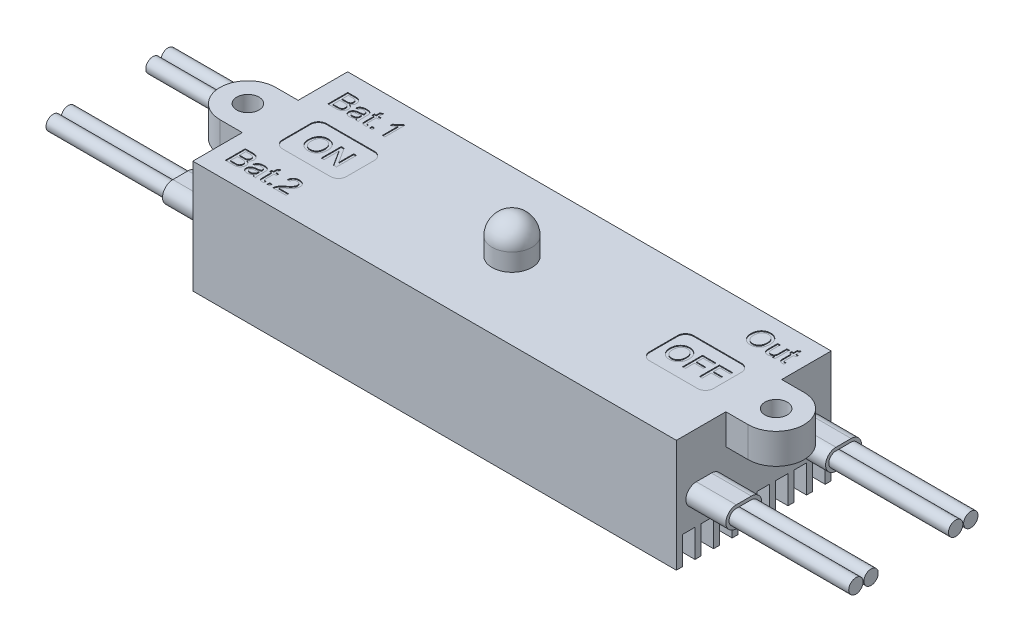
from build123d import *

# Parameters (mm, degrees)
ESQUISSE1_W             = 60.6
ESQUISSE1_H             = 19.4
BOSS_EXTRU_1_DEPTH      = 14.1
ESQUISSE2_W             = 1.58125
ESQUISSE2_H             = 3.5
ENL_V_MAT_EXTRU_1_DEPTH = 63.970310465
ESQUISSE3_R             = 1.4
BOSS_EXTRU_2_DEPTH      = 3.8
ESQUISSE5_R             = 0.9
BOSS_EXTRU_3_DEPTH      = 20
BOSS_EXTRU_4_START      = 20
ESQUISSE6_R             = 0.9
BOSS_EXTRU_4_DEPTH      = 20
BOSS_EXTRU_5_DEPTH      = 5
BOSS_EXTRU_5_2_DEPTH    = 5
BOSS_EXTRU_6_DEPTH      = 5
BOSS_EXTRU_6_2_DEPTH    = 5
ENL_V_MAT_EXTRU_2_DEPTH = 0.1
ENL_V_MAT_EXTRU_3_DEPTH = 0.1
ESQUISSE11_W            = 0.320512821
ESQUISSE11_H            = 0.32051282
ESQUISSE11_W_2          = 0.32051282
ESQUISSE11_H_2          = 0.320512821
ENL_V_MAT_EXTRU_4_DEPTH = 0.1


with BuildPart() as part:
    # Esquisse1 → Boss.-Extru.1 (new body)
    with BuildSketch(Plane(origin=(0, 0, 0), x_dir=(1, 0, 0), z_dir=(0, 1, 0))):
        Rectangle(ESQUISSE1_W, ESQUISSE1_H)
    extrude(amount=-BOSS_EXTRU_1_DEPTH)

    # Esquisse2 → Enl_v. mat.-Extru.1 (cut, through all)
    with BuildSketch(Plane.ZY.offset(30.3)):
        with Locations((-8.159375, -12.35)):
            Rectangle(ESQUISSE2_W, ESQUISSE2_H)
        with Locations((-5.828125, -12.35)):
            Rectangle(ESQUISSE2_W, ESQUISSE2_H)
        with Locations((-3.496875, -12.35)):
            Rectangle(ESQUISSE2_W, ESQUISSE2_H)
        with Locations((-1.165625, -12.35)):
            Rectangle(ESQUISSE2_W, ESQUISSE2_H)
        with Locations((1.165625, -12.35)):
            Rectangle(ESQUISSE2_W, ESQUISSE2_H)
        with Locations((3.496875, -12.35)):
            Rectangle(ESQUISSE2_W, ESQUISSE2_H)
        with Locations((5.828125, -12.35)):
            Rectangle(ESQUISSE2_W, ESQUISSE2_H)
        with Locations((8.159375, -12.35)):
            Rectangle(ESQUISSE2_W, ESQUISSE2_H)
    extrude(amount=-ENL_V_MAT_EXTRU_1_DEPTH, mode=Mode.SUBTRACT)

    # Esquisse3 → Boss.-Extru.2 (add)
    # profile 1 of 2: a face of its own
    with BuildSketch(Plane(origin=(0, 0, 0), x_dir=(1, 0, 0), z_dir=(0, 1, 0))):
        with BuildLine():
            Line((-33.1, 3.5), (-30.3, 3.5))
            ThreePointArc((-30.3, 3.5), (-26.8, 0), (-30.3, -3.5))
            Line((-30.3, -3.5), (-33.1, -3.5))
            ThreePointArc((-33.1, -3.5), (-36.6, 0), (-33.1, 3.5))
        make_face()
        with Locations(Location((-33.1, 0, 0), (0, 0, 270))):
            Circle(ESQUISSE3_R, mode=Mode.SUBTRACT)
    # profile 2 of 2: a face of its own
    with BuildSketch(Plane(origin=(0, 0, 0), x_dir=(1, 0, 0), z_dir=(0, 1, 0))):
        with BuildLine():
            Line((30.3, 3.5), (33.1, 3.5))
            ThreePointArc((33.1, 3.5), (36.6, 0), (33.1, -3.5))
            Line((33.1, -3.5), (30.3, -3.5))
            ThreePointArc((30.3, -3.5), (26.8, 0), (30.3, 3.5))
        make_face()
        with Locations(Location((33.1, 0, 0), (0, 0, 270))):
            Circle(ESQUISSE3_R, mode=Mode.SUBTRACT)
    extrude(amount=-BOSS_EXTRU_2_DEPTH)

    # Esquisse4 → R_volution1 (revolve)
    with BuildSketch(Plane.XY):
        with BuildLine():
            Line((0, 4.7), (0, 0))
            Line((0, 0), (2.5, 0))
            Line((2.5, 0), (2.5, 2.2))
            ThreePointArc((2.5, 2.2), (1.767766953, 3.967766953), (0, 4.7))
        make_face()
    revolve(axis=Axis((0, 0, 0), (0, 1, 0)))

    # Esquisse5 → Boss.-Extru.3 (add)
    with BuildSketch(Plane.ZY.offset(30.3)):
        with Locations((-7.2, -7.05)):
            Circle(ESQUISSE5_R)
        with Locations((-5.3, -7.05)):
            Circle(ESQUISSE5_R)
        with Locations((5.3, -7.05)):
            Circle(ESQUISSE5_R)
        with Locations((7.2, -7.05)):
            Circle(ESQUISSE5_R)
    extrude(amount=BOSS_EXTRU_3_DEPTH)

    # Esquisse6 → Boss.-Extru.4 (add)
    with BuildSketch(Plane(origin=(30.3, 0, 0), x_dir=(0, 0, -1), z_dir=(1, 0, 0)).offset(BOSS_EXTRU_4_START)):
        with Locations(Location((-7.2, -7.05, 0), (0, 0, 180))):
            Circle(ESQUISSE6_R)
        with Locations(Location((-5.3, -7.05, 0), (0, 0, 180))):
            Circle(ESQUISSE6_R)
        with Locations(Location((5.3, -7.05, 0), (0, 0, 180))):
            Circle(ESQUISSE6_R)
        with Locations(Location((7.2, -7.05, 0), (0, 0, 180))):
            Circle(ESQUISSE6_R)
    extrude(amount=-BOSS_EXTRU_4_DEPTH)

    # Esquisse9 → Enl_v. mat.-Extru.2 (cut)
    with BuildSketch(Plane(origin=(0, 0, 0), x_dir=(1, 0, 0), z_dir=(0, 1, 0))):
        with BuildLine():
            Line((-26, 2.75), (-20, 2.75))
            ThreePointArc((-20, 2.75), (-19.292893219, 2.457106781), (-19, 1.75))
            Line((-19, 1.75), (-19, -1.75))
            ThreePointArc((-19, -1.75), (-19.292893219, -2.457106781), (-20, -2.75))
            Line((-20, -2.75), (-26, -2.75))
            ThreePointArc((-26, -2.75), (-26.707106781, -2.457106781), (-27, -1.75))
            Line((-27, -1.75), (-27, 1.75))
            ThreePointArc((-27, 1.75), (-26.707106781, 2.457106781), (-26, 2.75))
        make_face()
        with BuildLine():
            Line((20, 2.75), (26, 2.75))
            ThreePointArc((26, 2.75), (26.707106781, 2.457106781), (27, 1.75))
            Line((27, 1.75), (27, -1.75))
            ThreePointArc((27, -1.75), (26.707106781, -2.457106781), (26, -2.75))
            Line((26, -2.75), (20, -2.75))
            ThreePointArc((20, -2.75), (19.292893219, -2.457106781), (19, -1.75))
            Line((19, -1.75), (19, 1.75))
            ThreePointArc((19, 1.75), (19.292893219, 2.457106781), (20, 2.75))
        make_face()
    extrude(amount=-ENL_V_MAT_EXTRU_2_DEPTH, mode=Mode.SUBTRACT)

    # Esquisse10 → Enl_v. mat.-Extru.3 (cut)
    # profile 1 of 5: a face of its own
    with BuildSketch(Plane(origin=(0, -0.1, 0), x_dir=(1, 0, 0), z_dir=(0, 1, 0))):
        with BuildLine():
            add(Edge.make_bspline(
                [(-25.507578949, -0.010916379), (-25.506710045, 0.039206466), (-25.50501703, 0.136868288), (-25.489198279, 0.279076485), (-25.463512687, 0.412875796), (-25.42679286, 0.538255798), (-25.380250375, 0.655412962), (-25.323669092, 0.764612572), (-25.255347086, 0.864618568), (-25.178057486, 0.956382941), (-25.091728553, 1.037509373), (-24.999812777, 1.109561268), (-24.901162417, 1.169661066), (-24.796688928, 1.219283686), (-24.685948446, 1.257382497), (-24.569251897, 1.284055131), (-24.446724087, 1.301261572), (-24.362973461, 1.303198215), (-24.320179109, 1.304187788)],
                knots=[0, 0, 0, 0, 1.203621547, 2.345195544, 3.432004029, 4.472479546, 5.478447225, 6.455936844, 7.420185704, 8.381829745, 9.332027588, 10.260832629, 11.182364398, 12.100723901, 13.034044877, 13.989196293, 14.972532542, 16, 16, 16, 16], degree=3))
            add(Edge.make_bspline(
                [(-24.320179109, 1.304187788), (-24.291953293, 1.303694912), (-24.235901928, 1.302716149), (-24.153034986, 1.295269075), (-24.072297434, 1.281977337), (-23.993768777, 1.264164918), (-23.91723526, 1.240795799), (-23.842651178, 1.213209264), (-23.770669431, 1.179025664), (-23.700811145, 1.140753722), (-23.633900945, 1.0979449), (-23.571018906, 1.050654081), (-23.512315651, 0.999238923), (-23.457002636, 0.944544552), (-23.406925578, 0.88472511), (-23.360015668, 0.821602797), (-23.317620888, 0.754058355), (-23.279590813, 0.682645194), (-23.245588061, 0.608466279), (-23.216526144, 0.531214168), (-23.191571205, 0.451815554), (-23.170681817, 0.369800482), (-23.155693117, 0.285196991), (-23.143757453, 0.198369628), (-23.137475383, 0.109034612), (-23.136352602, 0.048687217), (-23.135784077, 0.018130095)],
                knots=[0, 0, 0, 0, 1.034375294, 2.054082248, 3.045783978, 4.031219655, 5.002789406, 5.976610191, 6.94273282, 7.920236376, 8.894345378, 9.851183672, 10.800797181, 11.752517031, 12.698794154, 13.65688337, 14.632873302, 15.61821402, 16.620222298, 17.621258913, 18.640965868, 19.669244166, 20.720417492, 21.788124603, 22.880008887, 24, 24, 24, 24], degree=3))
            add(Edge.make_bspline(
                [(-23.135784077, 0.018130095), (-23.136304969, -0.012930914), (-23.137334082, -0.074297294), (-23.144297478, -0.164954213), (-23.156541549, -0.25300856), (-23.172781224, -0.338722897), (-23.194541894, -0.421918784), (-23.220401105, -0.50283475), (-23.251679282, -0.580988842), (-23.287004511, -0.656569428), (-23.326974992, -0.728537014), (-23.371065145, -0.796388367), (-23.419306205, -0.859488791), (-23.470965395, -0.918612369), (-23.527249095, -0.972701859), (-23.587464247, -1.022263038), (-23.651379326, -1.067763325), (-23.719209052, -1.107970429), (-23.78973613, -1.143213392), (-23.861564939, -1.17448025), (-23.934748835, -1.20114587), (-24.009537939, -1.222755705), (-24.085728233, -1.239085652), (-24.163105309, -1.251313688), (-24.241922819, -1.258354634), (-24.294958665, -1.259392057), (-24.321681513, -1.259914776)],
                knots=[0, 0, 0, 0, 1.141429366, 2.255090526, 3.338676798, 4.407031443, 5.458968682, 6.496860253, 7.526652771, 8.550250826, 9.560787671, 10.54935636, 11.521089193, 12.477323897, 13.431786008, 14.386110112, 15.340986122, 16.312041, 17.28047646, 18.236612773, 19.189437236, 20.140779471, 21.09494583, 22.051062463, 23.018000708, 24, 24, 24, 24], degree=3))
            add(Edge.make_bspline(
                [(-24.321681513, -1.259914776), (-24.35041451, -1.259489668), (-24.407327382, -1.258647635), (-24.491446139, -1.250242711), (-24.573472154, -1.237420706), (-24.653166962, -1.218909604), (-24.730421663, -1.194760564), (-24.805327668, -1.165531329), (-24.878148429, -1.131612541), (-24.947980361, -1.092032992), (-25.014585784, -1.048024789), (-25.077319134, -0.999806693), (-25.136145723, -0.947823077), (-25.190121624, -0.891214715), (-25.240994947, -0.832033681), (-25.286731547, -0.768080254), (-25.328825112, -0.700804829), (-25.366030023, -0.629558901), (-25.399639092, -0.556459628), (-25.427955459, -0.481483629), (-25.452840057, -0.40573585), (-25.472658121, -0.328749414), (-25.488450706, -0.25070191), (-25.499070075, -0.171723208), (-25.506739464, -0.091695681), (-25.507297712, -0.037978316), (-25.507578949, -0.010916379)],
                knots=[0, 0, 0, 0, 1.072727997, 2.12480551, 3.153819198, 4.171534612, 5.177148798, 6.173931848, 7.17235114, 8.174500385, 9.168706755, 10.151274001, 11.127173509, 12.097141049, 13.070188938, 14.039134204, 15.03036519, 16.031505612, 17.038625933, 18.033164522, 19.022845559, 20.014762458, 21.000193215, 21.994692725, 22.989758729, 24, 24, 24, 24], degree=3))
        make_face()
        with BuildLine():
            add(Edge.make_bspline(
                [(-25.155014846, -0.014922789), (-25.154474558, -0.05101576), (-25.153421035, -0.121394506), (-25.141368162, -0.224002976), (-25.123079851, -0.320819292), (-25.097871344, -0.412115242), (-25.063984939, -0.496987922), (-25.023469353, -0.576252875), (-24.974960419, -0.649383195), (-24.919528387, -0.716174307), (-24.858559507, -0.776174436), (-24.79340807, -0.828581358), (-24.724059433, -0.872468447), (-24.651282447, -0.908706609), (-24.574554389, -0.936993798), (-24.494105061, -0.95685635), (-24.409875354, -0.969278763), (-24.35244108, -0.970719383), (-24.323183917, -0.971453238)],
                knots=[0, 0, 0, 0, 1.215430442, 2.370003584, 3.475209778, 4.53279855, 5.55522989, 6.548792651, 7.526809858, 8.505409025, 9.467826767, 10.404123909, 11.316848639, 12.227335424, 13.138360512, 14.065900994, 15.014765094, 16, 16, 16, 16], degree=3))
            add(Edge.make_bspline(
                [(-24.323183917, -0.971453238), (-24.293430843, -0.970708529), (-24.235174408, -0.96925039), (-24.149674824, -0.957044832), (-24.068440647, -0.93626539), (-23.990666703, -0.908603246), (-23.917759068, -0.871208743), (-23.848012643, -0.827419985), (-23.783328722, -0.773911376), (-23.7221195, -0.71380513), (-23.667218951, -0.645483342), (-23.618506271, -0.570628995), (-23.578935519, -0.488119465), (-23.544771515, -0.399772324), (-23.519754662, -0.303917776), (-23.501265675, -0.201645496), (-23.49012382, -0.092626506), (-23.488950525, -0.017786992), (-23.48834818, 0.020634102)],
                knots=[0, 0, 0, 0, 0.976878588, 1.912725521, 2.8289017, 3.727303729, 4.617335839, 5.514666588, 6.426584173, 7.368641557, 8.327632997, 9.299405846, 10.294892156, 11.327373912, 12.405931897, 13.542618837, 14.738430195, 16, 16, 16, 16], degree=3))
            add(Edge.make_bspline(
                [(-23.48834818, 0.020634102), (-23.488561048, 0.045351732), (-23.48897862, 0.093838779), (-23.494508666, 0.16530924), (-23.501641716, 0.234556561), (-23.512501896, 0.301491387), (-23.527468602, 0.365836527), (-23.54404917, 0.428081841), (-23.564782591, 0.487690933), (-23.588307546, 0.544897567), (-23.614631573, 0.599408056), (-23.644321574, 0.650762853), (-23.67703249, 0.698762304), (-23.711881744, 0.74431643), (-23.750799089, 0.785662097), (-23.791910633, 0.824545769), (-23.836150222, 0.860164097), (-23.883076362, 0.892526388), (-23.932023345, 0.92165755), (-23.982890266, 0.946590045), (-24.034866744, 0.96849011), (-24.088822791, 0.985277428), (-24.144013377, 0.998816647), (-24.200661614, 1.009100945), (-24.258977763, 1.014426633), (-24.298301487, 1.015289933), (-24.318175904, 1.015726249)],
                knots=[0, 0, 0, 0, 1.220438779, 2.394059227, 3.538503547, 4.658058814, 5.74010225, 6.800155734, 7.837851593, 8.854470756, 9.853724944, 10.825214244, 11.781044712, 12.72106398, 13.654479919, 14.581868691, 15.514082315, 16.456304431, 17.39516604, 18.324312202, 19.252140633, 20.177768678, 21.111585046, 22.057694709, 23.018348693, 24, 24, 24, 24], degree=3))
            add(Edge.make_bspline(
                [(-24.318175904, 1.015726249), (-24.346265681, 1.015168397), (-24.401689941, 1.014067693), (-24.48328105, 1.00183166), (-24.561943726, 0.983549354), (-24.637800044, 0.957989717), (-24.710201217, 0.92414474), (-24.77952235, 0.882638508), (-24.846378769, 0.83460117), (-24.909716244, 0.778862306), (-24.968760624, 0.714831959), (-25.018676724, 0.639342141), (-25.060747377, 0.554194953), (-25.095875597, 0.459606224), (-25.12265983, 0.354843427), (-25.141171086, 0.240357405), (-25.152858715, 0.116027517), (-25.154277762, 0.029843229), (-25.155014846, -0.014922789)],
                knots=[0, 0, 0, 0, 0.895090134, 1.766112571, 2.624765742, 3.468151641, 4.313618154, 5.168136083, 6.041303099, 6.935189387, 7.854749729, 8.809996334, 9.809869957, 10.877771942, 12.021723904, 13.25217762, 14.572720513, 16, 16, 16, 16], degree=3))
        make_face(mode=Mode.SUBTRACT)
    # profile 2 of 5: a face of its own
    with BuildSketch(Plane(origin=(0, -0.1, 0), x_dir=(1, 0, 0), z_dir=(0, 1, 0))):
        Polygon((-22.687066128, -1.227863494), (-22.687066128, 1.272136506), (-22.314469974, 1.272136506), (-21.116553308, -0.59334827), (-21.116553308, 1.272136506), (-20.763989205, 1.272136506), (-20.763989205, -1.227863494), (-21.136585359, -1.227863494), (-22.334502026, 0.637621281), (-22.334502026, -1.227863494), align=None)
    # profile 3 of 5: a face of its own
    with BuildSketch(Plane(origin=(0, -0.1, 0), x_dir=(1, 0, 0), z_dir=(0, 1, 0))):
        with BuildLine():
            add(Edge.make_bspline(
                [(19.786944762, -0.010916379), (19.787813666, 0.039206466), (19.789506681, 0.136868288), (19.805325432, 0.279076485), (19.831011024, 0.412875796), (19.867730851, 0.538255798), (19.914273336, 0.655412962), (19.970854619, 0.764612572), (20.039176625, 0.864618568), (20.116466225, 0.956382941), (20.202795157, 1.037509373), (20.294710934, 1.109561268), (20.393361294, 1.169661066), (20.497834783, 1.219283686), (20.608575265, 1.257382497), (20.725271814, 1.284055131), (20.847799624, 1.301261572), (20.931550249, 1.303198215), (20.974344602, 1.304187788)],
                knots=[0, 0, 0, 0, 1.203621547, 2.345195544, 3.432004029, 4.472479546, 5.478447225, 6.455936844, 7.420185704, 8.381829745, 9.332027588, 10.260832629, 11.182364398, 12.100723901, 13.034044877, 13.989196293, 14.972532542, 16, 16, 16, 16], degree=3))
            add(Edge.make_bspline(
                [(20.974344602, 1.304187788), (21.002570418, 1.303694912), (21.058621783, 1.302716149), (21.141488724, 1.295269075), (21.222226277, 1.281977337), (21.300754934, 1.264164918), (21.377288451, 1.240795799), (21.451872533, 1.213209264), (21.52385428, 1.179025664), (21.593712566, 1.140753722), (21.660622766, 1.0979449), (21.723504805, 1.050654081), (21.78220806, 0.999238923), (21.837521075, 0.944544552), (21.887598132, 0.88472511), (21.934508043, 0.821602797), (21.976902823, 0.754058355), (22.014932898, 0.682645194), (22.04893565, 0.608466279), (22.077997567, 0.531214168), (22.102952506, 0.451815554), (22.123841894, 0.369800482), (22.138830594, 0.285196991), (22.150766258, 0.198369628), (22.157048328, 0.109034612), (22.158171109, 0.048687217), (22.158739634, 0.018130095)],
                knots=[0, 0, 0, 0, 1.034375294, 2.054082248, 3.045783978, 4.031219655, 5.002789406, 5.976610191, 6.94273282, 7.920236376, 8.894345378, 9.851183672, 10.800797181, 11.752517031, 12.698794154, 13.65688337, 14.632873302, 15.61821402, 16.620222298, 17.621258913, 18.640965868, 19.669244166, 20.720417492, 21.788124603, 22.880008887, 24, 24, 24, 24], degree=3))
            add(Edge.make_bspline(
                [(22.158739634, 0.018130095), (22.158218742, -0.012930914), (22.157189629, -0.074297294), (22.150226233, -0.164954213), (22.137982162, -0.25300856), (22.121742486, -0.338722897), (22.099981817, -0.421918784), (22.074122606, -0.50283475), (22.042844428, -0.580988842), (22.0075192, -0.656569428), (21.967548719, -0.728537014), (21.923458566, -0.796388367), (21.875217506, -0.859488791), (21.823558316, -0.918612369), (21.767274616, -0.972701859), (21.707059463, -1.022263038), (21.643144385, -1.067763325), (21.575314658, -1.107970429), (21.504787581, -1.143213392), (21.432958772, -1.17448025), (21.359774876, -1.20114587), (21.284985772, -1.222755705), (21.208795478, -1.239085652), (21.131418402, -1.251313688), (21.052600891, -1.258354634), (20.999565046, -1.259392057), (20.972842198, -1.259914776)],
                knots=[0, 0, 0, 0, 1.141429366, 2.255090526, 3.338676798, 4.407031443, 5.458968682, 6.496860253, 7.526652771, 8.550250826, 9.560787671, 10.54935636, 11.521089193, 12.477323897, 13.431786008, 14.386110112, 15.340986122, 16.312041, 17.28047646, 18.236612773, 19.189437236, 20.140779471, 21.09494583, 22.051062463, 23.018000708, 24, 24, 24, 24], degree=3))
            add(Edge.make_bspline(
                [(20.972842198, -1.259914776), (20.944109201, -1.259489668), (20.887196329, -1.258647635), (20.803077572, -1.250242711), (20.721051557, -1.237420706), (20.641356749, -1.218909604), (20.564102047, -1.194760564), (20.489196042, -1.165531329), (20.416375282, -1.131612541), (20.34654335, -1.092032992), (20.279937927, -1.048024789), (20.217204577, -0.999806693), (20.158377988, -0.947823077), (20.104402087, -0.891214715), (20.053528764, -0.832033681), (20.007792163, -0.768080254), (19.965698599, -0.700804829), (19.928493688, -0.629558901), (19.894884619, -0.556459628), (19.866568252, -0.481483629), (19.841683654, -0.40573585), (19.82186559, -0.328749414), (19.806073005, -0.25070191), (19.795453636, -0.171723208), (19.787784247, -0.091695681), (19.787225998, -0.037978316), (19.786944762, -0.010916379)],
                knots=[0, 0, 0, 0, 1.072727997, 2.12480551, 3.153819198, 4.171534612, 5.177148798, 6.173931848, 7.17235114, 8.174500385, 9.168706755, 10.151274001, 11.127173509, 12.097141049, 13.070188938, 14.039134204, 15.03036519, 16.031505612, 17.038625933, 18.033164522, 19.022845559, 20.014762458, 21.000193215, 21.994692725, 22.989758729, 24, 24, 24, 24], degree=3))
        make_face()
        with BuildLine():
            add(Edge.make_bspline(
                [(20.139508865, -0.014922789), (20.140049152, -0.05101576), (20.141102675, -0.121394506), (20.153155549, -0.224002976), (20.17144386, -0.320819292), (20.196652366, -0.412115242), (20.230538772, -0.496987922), (20.271054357, -0.576252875), (20.319563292, -0.649383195), (20.374995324, -0.716174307), (20.435964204, -0.776174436), (20.50111564, -0.828581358), (20.570464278, -0.872468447), (20.643241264, -0.908706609), (20.719969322, -0.936993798), (20.80041865, -0.95685635), (20.884648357, -0.969278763), (20.942082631, -0.970719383), (20.971339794, -0.971453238)],
                knots=[0, 0, 0, 0, 1.215430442, 2.370003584, 3.475209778, 4.53279855, 5.55522989, 6.548792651, 7.526809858, 8.505409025, 9.467826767, 10.404123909, 11.316848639, 12.227335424, 13.138360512, 14.065900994, 15.014765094, 16, 16, 16, 16], degree=3))
            add(Edge.make_bspline(
                [(20.971339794, -0.971453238), (21.001092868, -0.970708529), (21.059349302, -0.96925039), (21.144848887, -0.957044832), (21.226083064, -0.93626539), (21.303857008, -0.908603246), (21.376764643, -0.871208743), (21.446511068, -0.827419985), (21.511194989, -0.773911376), (21.572404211, -0.71380513), (21.62730476, -0.645483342), (21.67601744, -0.570628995), (21.715588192, -0.488119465), (21.749752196, -0.399772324), (21.774769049, -0.303917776), (21.793258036, -0.201645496), (21.804399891, -0.092626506), (21.805573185, -0.017786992), (21.806175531, 0.020634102)],
                knots=[0, 0, 0, 0, 0.976878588, 1.912725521, 2.8289017, 3.727303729, 4.617335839, 5.514666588, 6.426584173, 7.368641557, 8.327632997, 9.299405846, 10.294892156, 11.327373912, 12.405931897, 13.542618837, 14.738430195, 16, 16, 16, 16], degree=3))
            add(Edge.make_bspline(
                [(21.806175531, 0.020634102), (21.805962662, 0.045351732), (21.805545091, 0.093838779), (21.800015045, 0.16530924), (21.792881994, 0.234556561), (21.782021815, 0.301491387), (21.767055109, 0.365836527), (21.750474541, 0.428081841), (21.72974112, 0.487690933), (21.706216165, 0.544897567), (21.679892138, 0.599408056), (21.650202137, 0.650762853), (21.61749122, 0.698762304), (21.582641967, 0.74431643), (21.543724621, 0.785662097), (21.502613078, 0.824545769), (21.458373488, 0.860164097), (21.411447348, 0.892526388), (21.362500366, 0.92165755), (21.311633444, 0.946590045), (21.259656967, 0.96849011), (21.20570092, 0.985277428), (21.150510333, 0.998816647), (21.093862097, 1.009100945), (21.035545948, 1.014426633), (20.996222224, 1.015289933), (20.976347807, 1.015726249)],
                knots=[0, 0, 0, 0, 1.220438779, 2.394059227, 3.538503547, 4.658058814, 5.74010225, 6.800155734, 7.837851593, 8.854470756, 9.853724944, 10.825214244, 11.781044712, 12.72106398, 13.654479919, 14.581868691, 15.514082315, 16.456304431, 17.39516604, 18.324312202, 19.252140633, 20.177768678, 21.111585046, 22.057694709, 23.018348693, 24, 24, 24, 24], degree=3))
            add(Edge.make_bspline(
                [(20.976347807, 1.015726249), (20.94825803, 1.015168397), (20.89283377, 1.014067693), (20.811242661, 1.00183166), (20.732579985, 0.983549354), (20.656723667, 0.957989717), (20.584322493, 0.92414474), (20.515001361, 0.882638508), (20.448144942, 0.83460117), (20.384807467, 0.778862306), (20.325763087, 0.714831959), (20.275846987, 0.639342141), (20.233776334, 0.554194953), (20.198648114, 0.459606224), (20.17186388, 0.354843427), (20.153352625, 0.240357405), (20.141664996, 0.116027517), (20.140245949, 0.029843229), (20.139508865, -0.014922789)],
                knots=[0, 0, 0, 0, 0.895090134, 1.766112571, 2.624765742, 3.468151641, 4.313618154, 5.168136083, 6.041303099, 6.935189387, 7.854749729, 8.809996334, 9.809869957, 10.877771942, 12.021723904, 13.25217762, 14.572720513, 16, 16, 16, 16], degree=3))
        make_face(mode=Mode.SUBTRACT)
    # profile 4 of 5: a face of its own
    with BuildSketch(Plane(origin=(0, -0.1, 0), x_dir=(1, 0, 0), z_dir=(0, 1, 0))):
        Polygon((22.607457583, -1.227863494), (22.607457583, 1.272136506), (24.274124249, 1.272136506), (24.274124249, 0.983674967), (22.960021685, 0.983674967), (22.960021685, 0.182392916), (24.081816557, 0.182392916), (24.081816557, -0.106068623), (22.960021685, -0.106068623), (22.960021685, -1.227863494), align=None)
    # profile 5 of 5: a face of its own
    with BuildSketch(Plane(origin=(0, -0.1, 0), x_dir=(1, 0, 0), z_dir=(0, 1, 0))):
        Polygon((24.722842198, -1.227863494), (24.722842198, 1.272136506), (26.389508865, 1.272136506), (26.389508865, 0.983674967), (25.0754063, 0.983674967), (25.0754063, 0.182392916), (26.197201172, 0.182392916), (26.197201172, -0.106068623), (25.0754063, -0.106068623), (25.0754063, -1.227863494), align=None)
    extrude(amount=-ENL_V_MAT_EXTRU_3_DEPTH, mode=Mode.SUBTRACT)

    # Esquisse11 → Enl_v. mat.-Extru.4 (cut)
    # profile 1 of 13: a face of its own
    with BuildSketch(Plane(origin=(0, 0, 0), x_dir=(1, 0, 0), z_dir=(0, 1, 0))):
        with BuildLine():
            Line((-28.047843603, 4.967507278), (-28.047843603, 7.467507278))
            Line((-28.047843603, 7.467507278), (-27.111846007, 7.467507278))
            add(Edge.make_bspline(
                [(-27.111846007, 7.467507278), (-27.088634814, 7.467418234), (-27.04334318, 7.467244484), (-26.977208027, 7.462899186), (-26.9145731, 7.456955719), (-26.855303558, 7.449294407), (-26.799655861, 7.438178), (-26.747681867, 7.424711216), (-26.699111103, 7.409177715), (-26.639740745, 7.385515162), (-26.571322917, 7.349093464), (-26.498040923, 7.294746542), (-26.434282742, 7.229495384), (-26.381819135, 7.154681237), (-26.338594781, 7.074765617), (-26.30794922, 6.991270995), (-26.288355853, 6.90601525), (-26.286132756, 6.848286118), (-26.28502309, 6.819470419)],
                knots=[0, 0, 0, 0, 0.939712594, 1.833646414, 2.682508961, 3.487467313, 4.25240329, 4.978730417, 5.660668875, 6.315918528, 7.564895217, 8.787077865, 9.996481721, 11.241996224, 12.475862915, 13.665015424, 14.834484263, 16, 16, 16, 16], degree=3))
            add(Edge.make_bspline(
                [(-26.28502309, 6.819470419), (-26.286189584, 6.792661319), (-26.288511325, 6.739301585), (-26.306989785, 6.660699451), (-26.33615445, 6.584377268), (-26.377394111, 6.511262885), (-26.430103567, 6.442693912), (-26.495448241, 6.380990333), (-26.572489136, 6.326019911), (-26.630308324, 6.29671906), (-26.66012325, 6.281609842)],
                knots=[0, 0, 0, 0, 0.926741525, 1.844548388, 2.778836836, 3.746021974, 4.738420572, 5.759761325, 6.844803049, 8, 8, 8, 8], degree=3))
            add(Edge.make_bspline(
                [(-26.66012325, 6.281609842), (-26.64167954, 6.275836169), (-26.605569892, 6.264532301), (-26.553658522, 6.243847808), (-26.504929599, 6.220295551), (-26.459277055, 6.19383683), (-26.417009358, 6.164226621), (-26.37824577, 6.131418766), (-26.342717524, 6.095920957), (-26.310488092, 6.057754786), (-26.282177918, 6.017165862), (-26.256787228, 5.975041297), (-26.235820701, 5.93087382), (-26.218635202, 5.884778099), (-26.205227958, 5.837038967), (-26.195600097, 5.78747281), (-26.190112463, 5.736195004), (-26.189288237, 5.701360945), (-26.188869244, 5.683653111)],
                knots=[0, 0, 0, 0, 1.127427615, 2.20731145, 3.257257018, 4.283066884, 5.282973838, 6.264540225, 7.242620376, 8.210460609, 9.17525685, 10.12748095, 11.077310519, 12.023587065, 12.994999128, 13.967387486, 14.966724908, 16, 16, 16, 16], degree=3))
            add(Edge.make_bspline(
                [(-26.188869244, 5.683653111), (-26.189732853, 5.655223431), (-26.191444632, 5.598872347), (-26.205192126, 5.515933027), (-26.228424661, 5.436152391), (-26.26040227, 5.360820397), (-26.298504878, 5.291164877), (-26.341809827, 5.22900964), (-26.389212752, 5.17499426), (-26.442048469, 5.12955767), (-26.499976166, 5.090995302), (-26.564631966, 5.058523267), (-26.635515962, 5.029886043), (-26.714068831, 5.007009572), (-26.800254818, 4.988836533), (-26.895243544, 4.97702948), (-26.999180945, 4.968577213), (-27.0715954, 4.96787389), (-27.109342, 4.967507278)],
                knots=[0, 0, 0, 0, 1.028073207, 2.037766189, 3.031549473, 4.027532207, 4.992436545, 5.898794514, 6.762903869, 7.584966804, 8.412380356, 9.273953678, 10.198004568, 11.174406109, 12.229717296, 13.381036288, 14.634844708, 16, 16, 16, 16], degree=3))
            Line((-27.109342, 4.967507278), (-28.047843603, 4.967507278))
        make_face()
        with BuildLine():
            Line((-27.6952795, 6.40981497), (-27.179954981, 6.40981497))
            add(Edge.make_bspline(
                [(-27.179954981, 6.40981497), (-27.16309228, 6.409881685), (-27.130695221, 6.41000986), (-27.083963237, 6.411797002), (-27.040831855, 6.41332169), (-27.001467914, 6.41714854), (-26.965676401, 6.420896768), (-26.933600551, 6.425942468), (-26.905083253, 6.431627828), (-26.887622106, 6.436901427), (-26.879474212, 6.439362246)],
                knots=[0, 0, 0, 0, 1.335841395, 2.566453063, 3.705076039, 4.753984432, 5.69893722, 6.555639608, 7.326018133, 8, 8, 8, 8], degree=3))
            add(Edge.make_bspline(
                [(-26.879474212, 6.439362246), (-26.860329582, 6.446068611), (-26.823422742, 6.45899708), (-26.773964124, 6.488358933), (-26.731839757, 6.523593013), (-26.697162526, 6.565321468), (-26.670514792, 6.613320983), (-26.650756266, 6.666596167), (-26.639938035, 6.725891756), (-26.638392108, 6.767011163), (-26.637587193, 6.788420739)],
                knots=[0, 0, 0, 0, 1.059015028, 2.041559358, 2.989777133, 3.920090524, 4.862499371, 5.848878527, 6.879979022, 8, 8, 8, 8], degree=3))
            add(Edge.make_bspline(
                [(-26.637587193, 6.788420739), (-26.638234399, 6.808996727), (-26.63949573, 6.849096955), (-26.650083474, 6.907329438), (-26.668405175, 6.96150407), (-26.693217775, 7.011608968), (-26.724637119, 7.056184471), (-26.762137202, 7.094508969), (-26.807059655, 7.123480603), (-26.849048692, 7.141553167), (-26.886814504, 7.152859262), (-26.92055693, 7.159548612), (-26.958830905, 7.165442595), (-27.001762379, 7.170453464), (-27.049367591, 7.17434236), (-27.101793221, 7.177431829), (-27.158914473, 7.178743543), (-27.198484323, 7.178942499), (-27.219017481, 7.179045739)],
                knots=[0, 0, 0, 0, 1.216168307, 2.37017178, 3.484610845, 4.588286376, 5.664695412, 6.69777344, 7.738183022, 8.803673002, 9.390844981, 10.0665252, 10.835811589, 11.680682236, 12.621801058, 13.660007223, 14.785756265, 16, 16, 16, 16], degree=3))
            Line((-27.219017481, 7.179045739), (-27.6952795, 7.179045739))
            Line((-27.6952795, 7.179045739), (-27.6952795, 6.40981497))
        make_face(mode=Mode.SUBTRACT)
        with BuildLine():
            Line((-27.6952795, 5.255968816), (-27.103833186, 5.255968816))
            add(Edge.make_bspline(
                [(-27.103833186, 5.255968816), (-27.080294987, 5.256239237), (-27.037048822, 5.256736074), (-26.977896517, 5.258294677), (-26.930083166, 5.26210176), (-26.902162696, 5.266201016), (-26.889991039, 5.267988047)],
                knots=[0, 0, 0, 0, 1.317581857, 2.420761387, 3.311546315, 4, 4, 4, 4], degree=3))
            add(Edge.make_bspline(
                [(-26.889991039, 5.267988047), (-26.872540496, 5.271655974), (-26.838751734, 5.27875803), (-26.791117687, 5.294609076), (-26.747443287, 5.312767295), (-26.708490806, 5.335844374), (-26.672421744, 5.362439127), (-26.641075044, 5.395657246), (-26.612203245, 5.433398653), (-26.587188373, 5.476589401), (-26.566960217, 5.524369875), (-26.551500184, 5.576001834), (-26.543265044, 5.631304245), (-26.542052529, 5.669272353), (-26.541433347, 5.688661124)],
                knots=[0, 0, 0, 0, 1.067651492, 2.067249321, 3.003744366, 3.895862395, 4.774133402, 5.679610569, 6.621910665, 7.616993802, 8.661192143, 9.724711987, 10.838102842, 12, 12, 12, 12], degree=3))
            add(Edge.make_bspline(
                [(-26.541433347, 5.688661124), (-26.542123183, 5.711424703), (-26.543468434, 5.755816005), (-26.556255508, 5.819963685), (-26.577377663, 5.879461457), (-26.607111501, 5.933485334), (-26.643581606, 5.982075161), (-26.68770675, 6.023292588), (-26.739156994, 6.056000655), (-26.798090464, 6.081670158), (-26.866971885, 6.099933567), (-26.947702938, 6.112324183), (-27.041574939, 6.120319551), (-27.10865571, 6.120994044), (-27.14439809, 6.121353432)],
                knots=[0, 0, 0, 0, 0.96167883, 1.875371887, 2.752872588, 3.621584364, 4.472914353, 5.312011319, 6.159851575, 7.038572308, 8.019870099, 9.164119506, 10.488969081, 12, 12, 12, 12], degree=3))
            Line((-27.14439809, 6.121353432), (-27.6952795, 6.121353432))
            Line((-27.6952795, 6.121353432), (-27.6952795, 5.255968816))
        make_face(mode=Mode.SUBTRACT)
    # profile 2 of 13: a face of its own
    with BuildSketch(Plane(origin=(0, 0, 0), x_dir=(1, 0, 0), z_dir=(0, 1, 0))):
        with BuildLine():
            add(Edge.make_bspline(
                [(-24.650407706, 5.191866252), (-24.67849752, 5.169773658), (-24.732615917, 5.127209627), (-24.815290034, 5.072116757), (-24.895191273, 5.026747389), (-24.973914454, 4.992057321), (-25.052923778, 4.966775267), (-25.133526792, 4.948742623), (-25.216983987, 4.93726456), (-25.273700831, 4.936064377), (-25.302450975, 4.935455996)],
                knots=[0, 0, 0, 0, 1.197047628, 2.306255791, 3.325459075, 4.272204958, 5.183179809, 6.100503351, 7.037132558, 8, 8, 8, 8], degree=3))
            add(Edge.make_bspline(
                [(-25.302450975, 4.935455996), (-25.325834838, 4.936001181), (-25.37119278, 4.937058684), (-25.437221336, 4.943375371), (-25.499041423, 4.954887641), (-25.556757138, 4.971047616), (-25.610774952, 4.990669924), (-25.660134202, 5.016099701), (-25.705508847, 5.045548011), (-25.746093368, 5.079806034), (-25.782067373, 5.117463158), (-25.813921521, 5.157513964), (-25.840519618, 5.200492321), (-25.862777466, 5.245683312), (-25.879939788, 5.293727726), (-25.891787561, 5.344301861), (-25.898917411, 5.397325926), (-25.899904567, 5.433397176), (-25.900407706, 5.451782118)],
                knots=[0, 0, 0, 0, 1.258692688, 2.441500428, 3.565802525, 4.638326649, 5.664695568, 6.653201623, 7.620115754, 8.570354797, 9.504485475, 10.41940588, 11.319425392, 12.219534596, 13.126122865, 14.058869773, 15.010636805, 16, 16, 16, 16], degree=3))
            add(Edge.make_bspline(
                [(-25.900407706, 5.451782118), (-25.899810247, 5.473536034), (-25.898634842, 5.516333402), (-25.887068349, 5.578841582), (-25.869247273, 5.63854464), (-25.843428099, 5.694493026), (-25.812101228, 5.74636652), (-25.775682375, 5.793299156), (-25.735227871, 5.835266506), (-25.689435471, 5.87089276), (-25.640302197, 5.901653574), (-25.588343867, 5.929038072), (-25.533332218, 5.952070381), (-25.495029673, 5.964066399), (-25.475728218, 5.970111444)],
                knots=[0, 0, 0, 0, 1.081160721, 2.127011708, 3.15154375, 4.173548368, 5.183333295, 6.160067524, 7.123185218, 8.075175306, 9.03822139, 10.004020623, 10.994184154, 12, 12, 12, 12], degree=3))
            add(Edge.make_bspline(
                [(-25.475728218, 5.970111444), (-25.459410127, 5.974305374), (-25.423172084, 5.983618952), (-25.362662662, 5.994356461), (-25.291280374, 6.00621628), (-25.239879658, 6.012704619), (-25.212306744, 6.016185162)],
                knots=[0, 0, 0, 0, 0.755247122, 1.677198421, 2.753978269, 4, 4, 4, 4], degree=3))
            add(Edge.make_bspline(
                [(-25.212306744, 6.016185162), (-25.183422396, 6.019986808), (-25.127621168, 6.027331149), (-25.046729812, 6.038602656), (-24.97178047, 6.051124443), (-24.902722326, 6.064295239), (-24.839438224, 6.076905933), (-24.782381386, 6.091064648), (-24.731025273, 6.105379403), (-24.699110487, 6.116211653), (-24.683961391, 6.121353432)],
                knots=[0, 0, 0, 0, 1.295688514, 2.50312072, 3.632112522, 4.674678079, 5.629835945, 6.501350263, 7.28863104, 8, 8, 8, 8], degree=3))
            add(Edge.make_bspline(
                [(-24.683961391, 6.121353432), (-24.683791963, 6.13020087), (-24.683485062, 6.146227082), (-24.683108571, 6.167597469), (-24.682372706, 6.183615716), (-24.682434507, 6.192466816), (-24.682458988, 6.195972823)],
                knots=[0, 0, 0, 0, 1.422721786, 2.577112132, 3.436380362, 4, 4, 4, 4], degree=3))
            add(Edge.make_bspline(
                [(-24.682458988, 6.195972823), (-24.682822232, 6.209999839), (-24.683519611, 6.236929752), (-24.686730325, 6.275831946), (-24.693326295, 6.311502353), (-24.702214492, 6.344058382), (-24.713494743, 6.373566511), (-24.728437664, 6.399093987), (-24.744764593, 6.422395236), (-24.758342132, 6.435066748), (-24.765091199, 6.441365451)],
                knots=[0, 0, 0, 0, 1.26154989, 2.42199954, 3.505345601, 4.517638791, 5.454101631, 6.334651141, 7.172195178, 8, 8, 8, 8], degree=3))
            add(Edge.make_bspline(
                [(-24.765091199, 6.441365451), (-24.774744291, 6.449162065), (-24.794482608, 6.465104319), (-24.82846042, 6.4840436), (-24.864885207, 6.501416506), (-24.905112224, 6.514881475), (-24.948541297, 6.52522311), (-24.995416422, 6.532684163), (-25.045616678, 6.537226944), (-25.080252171, 6.537750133), (-25.098124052, 6.538020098)],
                knots=[0, 0, 0, 0, 0.839762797, 1.717118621, 2.62848608, 3.573318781, 4.586191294, 5.652292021, 6.78858503, 8, 8, 8, 8], degree=3))
            add(Edge.make_bspline(
                [(-25.098124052, 6.538020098), (-25.114822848, 6.537849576), (-25.146914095, 6.537521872), (-25.193538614, 6.534410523), (-25.236694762, 6.529619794), (-25.276677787, 6.522596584), (-25.312967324, 6.513665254), (-25.346247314, 6.50314905), (-25.376055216, 6.490403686), (-25.411487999, 6.469930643), (-25.45135985, 6.437120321), (-25.490396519, 6.385163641), (-25.524660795, 6.322455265), (-25.539825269, 6.274771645), (-25.547843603, 6.24955856)],
                knots=[0, 0, 0, 0, 1.022193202, 1.964420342, 2.859404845, 3.679355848, 4.447752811, 5.145854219, 5.814144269, 6.427678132, 7.647232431, 8.943346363, 10.383770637, 12, 12, 12, 12], degree=3))
            Line((-25.547843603, 6.24955856), (-25.868356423, 6.281609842))
            add(Edge.make_bspline(
                [(-25.868356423, 6.281609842), (-25.861002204, 6.311684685), (-25.846801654, 6.369757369), (-25.81555564, 6.450751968), (-25.777737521, 6.522681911), (-25.73343045, 6.586892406), (-25.678969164, 6.642276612), (-25.615089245, 6.691029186), (-25.540123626, 6.731674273), (-25.455643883, 6.766160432), (-25.362312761, 6.793348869), (-25.261208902, 6.812673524), (-25.153146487, 6.824215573), (-25.078788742, 6.825711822), (-25.040531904, 6.826481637)],
                knots=[0, 0, 0, 0, 1.021253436, 1.971977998, 2.856928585, 3.699335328, 4.537187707, 5.410097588, 6.342486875, 7.343316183, 8.417452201, 9.545747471, 10.737294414, 12, 12, 12, 12], degree=3))
            add(Edge.make_bspline(
                [(-25.040531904, 6.826481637), (-25.003115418, 6.825827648), (-24.931808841, 6.824581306), (-24.830445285, 6.814805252), (-24.73994032, 6.798198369), (-24.660501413, 6.774141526), (-24.591446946, 6.744878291), (-24.531826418, 6.712675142), (-24.481918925, 6.676467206), (-24.441240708, 6.636022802), (-24.408607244, 6.5907755), (-24.382226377, 6.540714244), (-24.360192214, 6.485536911), (-24.350454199, 6.446185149), (-24.345419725, 6.425840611)],
                knots=[0, 0, 0, 0, 1.532418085, 2.920410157, 4.166262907, 5.295392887, 6.3126657, 7.233843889, 8.065362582, 8.82930282, 9.573337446, 10.341184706, 11.142406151, 12, 12, 12, 12], degree=3))
            add(Edge.make_bspline(
                [(-24.345419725, 6.425840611), (-24.342831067, 6.410345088), (-24.336875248, 6.374693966), (-24.333545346, 6.313353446), (-24.330217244, 6.237579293), (-24.330008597, 6.182124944), (-24.329894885, 6.15190231)],
                knots=[0, 0, 0, 0, 0.685842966, 1.577944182, 2.67997895, 4, 4, 4, 4], degree=3))
            Line((-24.329894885, 6.15190231), (-24.329894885, 5.760776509))
            add(Edge.make_bspline(
                [(-24.329894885, 5.760776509), (-24.329710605, 5.72805757), (-24.329358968, 5.665624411), (-24.329126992, 5.57630944), (-24.327750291, 5.49583326), (-24.32496034, 5.423900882), (-24.322656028, 5.360617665), (-24.319870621, 5.30582513), (-24.315896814, 5.259903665), (-24.310017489, 5.21031511), (-24.299766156, 5.154711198), (-24.282398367, 5.090913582), (-24.261292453, 5.02804957), (-24.242943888, 4.98772989), (-24.233741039, 4.967507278)],
                knots=[0, 0, 0, 0, 1.460752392, 2.787357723, 3.987454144, 5.053844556, 6.001073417, 6.814649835, 7.502887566, 8.058452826, 9.043678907, 10.023506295, 11.008675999, 12, 12, 12, 12], degree=3))
            Line((-24.233741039, 4.967507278), (-24.554253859, 4.967507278))
            add(Edge.make_bspline(
                [(-24.554253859, 4.967507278), (-24.566117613, 4.9838887), (-24.589827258, 5.016626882), (-24.616368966, 5.071722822), (-24.638222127, 5.129909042), (-24.64630548, 5.171008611), (-24.650407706, 5.191866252)],
                knots=[0, 0, 0, 0, 0.98283144, 1.964183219, 2.966842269, 4, 4, 4, 4], degree=3))
        make_face()
        with BuildLine():
            add(Edge.make_bspline(
                [(-24.682458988, 5.832891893), (-24.696590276, 5.827864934), (-24.726412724, 5.817256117), (-24.774513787, 5.804483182), (-24.827069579, 5.790455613), (-24.885036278, 5.778401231), (-24.947700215, 5.765635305), (-25.015727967, 5.75430995), (-25.08852264, 5.743312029), (-25.138844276, 5.736656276), (-25.164730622, 5.733232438)],
                knots=[0, 0, 0, 0, 0.729352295, 1.539213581, 2.419656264, 3.375381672, 4.41857158, 5.530700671, 6.729748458, 8, 8, 8, 8], degree=3))
            add(Edge.make_bspline(
                [(-25.164730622, 5.733232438), (-25.192979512, 5.729469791), (-25.245119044, 5.722525), (-25.316286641, 5.709550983), (-25.374215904, 5.696327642), (-25.420504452, 5.682356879), (-25.458114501, 5.665884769), (-25.489268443, 5.645423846), (-25.516878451, 5.622475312), (-25.53930839, 5.595628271), (-25.557629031, 5.566786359), (-25.569972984, 5.535622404), (-25.578673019, 5.503336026), (-25.579485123, 5.481053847), (-25.579894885, 5.469810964)],
                knots=[0, 0, 0, 0, 1.886220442, 3.481434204, 4.78676141, 5.817751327, 6.678319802, 7.493641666, 8.277504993, 9.045791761, 9.800124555, 10.528599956, 11.257578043, 12, 12, 12, 12], degree=3))
            add(Edge.make_bspline(
                [(-25.579894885, 5.469810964), (-25.578950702, 5.452786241), (-25.577095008, 5.419325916), (-25.558821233, 5.372036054), (-25.530383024, 5.329264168), (-25.490833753, 5.291437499), (-25.439906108, 5.26087624), (-25.378544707, 5.238923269), (-25.307138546, 5.226266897), (-25.256263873, 5.224730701), (-25.229333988, 5.223917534)],
                knots=[0, 0, 0, 0, 0.849267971, 1.669148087, 2.501462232, 3.405991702, 4.385156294, 5.453560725, 6.652073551, 8, 8, 8, 8], degree=3))
            add(Edge.make_bspline(
                [(-25.229333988, 5.223917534), (-25.201715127, 5.224643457), (-25.14757595, 5.226066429), (-25.068915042, 5.241382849), (-24.994594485, 5.264522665), (-24.9262881, 5.297916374), (-24.864569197, 5.337466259), (-24.811139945, 5.382281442), (-24.765637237, 5.431151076), (-24.742829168, 5.468063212), (-24.731537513, 5.486337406)],
                knots=[0, 0, 0, 0, 1.124426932, 2.204129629, 3.254288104, 4.289056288, 5.293189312, 6.235005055, 7.126199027, 8, 8, 8, 8], degree=3))
            add(Edge.make_bspline(
                [(-24.731537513, 5.486337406), (-24.723923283, 5.502146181), (-24.707549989, 5.536140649), (-24.694666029, 5.595672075), (-24.685242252, 5.664308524), (-24.684407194, 5.713488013), (-24.683961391, 5.739742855)],
                knots=[0, 0, 0, 0, 0.806621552, 1.73452216, 2.790557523, 4, 4, 4, 4], degree=3))
            Line((-24.683961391, 5.739742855), (-24.682458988, 5.832891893))
        make_face(mode=Mode.SUBTRACT)
    # profile 3 of 13: a face of its own
    with BuildSketch(Plane(origin=(0, 0, 0), x_dir=(1, 0, 0), z_dir=(0, 1, 0))):
        with BuildLine():
            Line((-23.208100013, 5.231930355), (-23.176048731, 4.963000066))
            add(Edge.make_bspline(
                [(-23.176048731, 4.963000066), (-23.196542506, 4.958766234), (-23.236208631, 4.950571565), (-23.29442784, 4.942386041), (-23.349190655, 4.936132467), (-23.384699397, 4.935676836), (-23.401910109, 4.935455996)],
                knots=[0, 0, 0, 0, 1.101333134, 2.13165308, 3.094431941, 4, 4, 4, 4], degree=3))
            add(Edge.make_bspline(
                [(-23.401910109, 4.935455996), (-23.427477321, 4.936153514), (-23.475802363, 4.937471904), (-23.54401943, 4.946512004), (-23.603192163, 4.962919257), (-23.653812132, 4.985484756), (-23.695843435, 5.014019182), (-23.731206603, 5.046585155), (-23.759834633, 5.083248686), (-23.778804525, 5.117757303), (-23.789971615, 5.149922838), (-23.797351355, 5.179917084), (-23.80299046, 5.215985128), (-23.808622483, 5.257519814), (-23.812566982, 5.305155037), (-23.814624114, 5.358456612), (-23.817027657, 5.417707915), (-23.817058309, 5.459124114), (-23.817074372, 5.480828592)],
                knots=[0, 0, 0, 0, 1.515965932, 2.865354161, 4.068592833, 5.144966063, 6.135994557, 7.067504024, 7.984224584, 8.88319335, 9.387210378, 9.999362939, 10.71208193, 11.550605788, 12.484373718, 13.544606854, 14.713232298, 16, 16, 16, 16], degree=3))
            Line((-23.817074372, 5.480828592), (-23.817074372, 6.505968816))
            Line((-23.817074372, 6.505968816), (-24.041433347, 6.505968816))
            Line((-24.041433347, 6.505968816), (-24.041433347, 6.794430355))
            Line((-24.041433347, 6.794430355), (-23.817074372, 6.794430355))
            Line((-23.817074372, 6.794430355), (-23.817074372, 7.239141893))
            Line((-23.817074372, 7.239141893), (-23.496561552, 7.42143356))
            Line((-23.496561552, 7.42143356), (-23.496561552, 6.794430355))
            Line((-23.496561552, 6.794430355), (-23.208100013, 6.794430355))
            Line((-23.208100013, 6.794430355), (-23.208100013, 6.505968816))
            Line((-23.208100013, 6.505968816), (-23.496561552, 6.505968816))
            Line((-23.496561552, 6.505968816), (-23.496561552, 5.469310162))
            add(Edge.make_bspline(
                [(-23.496561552, 5.469310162), (-23.496438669, 5.449772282), (-23.496216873, 5.414507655), (-23.493159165, 5.367380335), (-23.489382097, 5.331592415), (-23.481431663, 5.299188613), (-23.46284602, 5.26980027), (-23.438050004, 5.247499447), (-23.412868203, 5.234874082), (-23.389520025, 5.228794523), (-23.362821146, 5.224743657), (-23.343834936, 5.22420317), (-23.333801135, 5.223917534)],
                knots=[0, 0, 0, 0, 1.693748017, 3.05710712, 4.093010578, 4.8128101, 5.929870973, 7.047775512, 7.662723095, 8.354621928, 9.130453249, 10, 10, 10, 10], degree=3))
            add(Edge.make_bspline(
                [(-23.333801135, 5.223917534), (-23.325285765, 5.224028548), (-23.306908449, 5.22426813), (-23.277354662, 5.225912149), (-23.243958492, 5.228380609), (-23.22044845, 5.230707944), (-23.208100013, 5.231930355)],
                knots=[0, 0, 0, 0, 0.810958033, 1.750156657, 2.818290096, 4, 4, 4, 4], degree=3))
        make_face()
    # profile 4 of 13: a face of its own
    with BuildSketch(Plane(origin=(0, 0, 0), x_dir=(1, 0, 0), z_dir=(0, 1, 0))):
        with Locations((-22.663228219, 5.127763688)):
            Rectangle(ESQUISSE11_W, ESQUISSE11_H)
    # profile 5 of 13: a face of its own
    with BuildSketch(Plane(origin=(0, 0, 0), x_dir=(1, 0, 0), z_dir=(0, 1, 0))):
        with BuildLine():
            Line((-20.900407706, 4.967507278), (-21.220920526, 4.967507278))
            Line((-21.220920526, 4.967507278), (-21.220920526, 6.915624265))
            add(Edge.make_bspline(
                [(-21.220920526, 6.915624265), (-21.239375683, 6.897826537), (-21.277732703, 6.86083591), (-21.342571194, 6.808484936), (-21.414939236, 6.755425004), (-21.493897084, 6.704401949), (-21.574381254, 6.656369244), (-21.652158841, 6.61317121), (-21.725931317, 6.576615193), (-21.774525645, 6.556626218), (-21.797843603, 6.547034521)],
                knots=[0, 0, 0, 0, 0.893362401, 1.856755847, 2.901947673, 4.020460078, 5.132200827, 6.168787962, 7.121294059, 8, 8, 8, 8], degree=3))
            Line((-21.797843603, 6.547034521), (-21.797843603, 6.842507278))
            add(Edge.make_bspline(
                [(-21.797843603, 6.842507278), (-21.757792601, 6.863133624), (-21.678854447, 6.903786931), (-21.567331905, 6.974000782), (-21.463213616, 7.050115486), (-21.368223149, 7.132114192), (-21.283070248, 7.215931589), (-21.211310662, 7.300506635), (-21.151266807, 7.382739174), (-21.121141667, 7.440087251), (-21.106737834, 7.467507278)],
                knots=[0, 0, 0, 0, 1.141258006, 2.249351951, 3.335817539, 4.406819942, 5.426913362, 6.360259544, 7.215985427, 8, 8, 8, 8], degree=3))
            Line((-21.106737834, 7.467507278), (-20.900407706, 7.467507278))
            Line((-20.900407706, 7.467507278), (-20.900407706, 4.967507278))
        make_face()
    # profile 6 of 13: a face of its own
    with BuildSketch(Plane(origin=(0, 0, 0), x_dir=(1, 0, 0), z_dir=(0, 1, 0))):
        with BuildLine():
            Line((-28.359349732, -7.565064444), (-28.359349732, -5.065064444))
            Line((-28.359349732, -5.065064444), (-27.423352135, -5.065064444))
            add(Edge.make_bspline(
                [(-27.423352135, -5.065064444), (-27.400140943, -5.065153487), (-27.354849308, -5.065327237), (-27.288714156, -5.069672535), (-27.226079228, -5.075616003), (-27.166809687, -5.083277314), (-27.11116199, -5.094393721), (-27.059187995, -5.107860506), (-27.010617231, -5.123394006), (-26.951246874, -5.147056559), (-26.882829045, -5.183478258), (-26.809547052, -5.237825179), (-26.74578887, -5.303076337), (-26.693325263, -5.377890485), (-26.650100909, -5.457806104), (-26.619455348, -5.541300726), (-26.599861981, -5.626556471), (-26.597638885, -5.684285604), (-26.596529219, -5.713101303)],
                knots=[0, 0, 0, 0, 0.939712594, 1.833646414, 2.682508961, 3.487467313, 4.25240329, 4.978730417, 5.660668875, 6.315918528, 7.564895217, 8.787077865, 9.996481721, 11.241996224, 12.475862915, 13.665015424, 14.834484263, 16, 16, 16, 16], degree=3))
            add(Edge.make_bspline(
                [(-26.596529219, -5.713101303), (-26.597695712, -5.739910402), (-26.600017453, -5.793270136), (-26.618495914, -5.87187227), (-26.647660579, -5.948194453), (-26.68890024, -6.021308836), (-26.741609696, -6.089877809), (-26.80695437, -6.151581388), (-26.883995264, -6.206551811), (-26.941814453, -6.235852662), (-26.971629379, -6.250961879)],
                knots=[0, 0, 0, 0, 0.926741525, 1.844548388, 2.778836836, 3.746021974, 4.738420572, 5.759761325, 6.844803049, 8, 8, 8, 8], degree=3))
            add(Edge.make_bspline(
                [(-26.971629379, -6.250961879), (-26.953185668, -6.256735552), (-26.91707602, -6.26803942), (-26.86516465, -6.288723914), (-26.816435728, -6.31227617), (-26.770783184, -6.338734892), (-26.728515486, -6.3683451), (-26.689751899, -6.401152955), (-26.654223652, -6.436650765), (-26.621994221, -6.474816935), (-26.593684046, -6.51540586), (-26.568293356, -6.557530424), (-26.547326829, -6.601697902), (-26.530141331, -6.647793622), (-26.516734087, -6.695532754), (-26.507106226, -6.745098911), (-26.501618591, -6.796376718), (-26.500794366, -6.831210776), (-26.500375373, -6.84891861)],
                knots=[0, 0, 0, 0, 1.127427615, 2.20731145, 3.257257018, 4.283066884, 5.282973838, 6.264540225, 7.242620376, 8.210460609, 9.17525685, 10.12748095, 11.077310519, 12.023587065, 12.994999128, 13.967387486, 14.966724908, 16, 16, 16, 16], degree=3))
            add(Edge.make_bspline(
                [(-26.500375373, -6.84891861), (-26.501238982, -6.87734829), (-26.502950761, -6.933699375), (-26.516698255, -7.016638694), (-26.53993079, -7.09641933), (-26.571908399, -7.171751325), (-26.610011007, -7.241406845), (-26.653315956, -7.303562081), (-26.70071888, -7.357577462), (-26.753554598, -7.403014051), (-26.811482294, -7.441576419), (-26.876138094, -7.474048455), (-26.94702209, -7.502685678), (-27.02557496, -7.52556215), (-27.111760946, -7.543735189), (-27.206749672, -7.555542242), (-27.310687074, -7.563994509), (-27.383101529, -7.564697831), (-27.420848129, -7.565064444)],
                knots=[0, 0, 0, 0, 1.028073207, 2.037766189, 3.031549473, 4.027532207, 4.992436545, 5.898794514, 6.762903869, 7.584966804, 8.412380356, 9.273953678, 10.198004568, 11.174406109, 12.229717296, 13.381036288, 14.634844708, 16, 16, 16, 16], degree=3))
            Line((-27.420848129, -7.565064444), (-28.359349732, -7.565064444))
        make_face()
        with BuildLine():
            Line((-28.006785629, -6.122756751), (-27.49146111, -6.122756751))
            add(Edge.make_bspline(
                [(-27.49146111, -6.122756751), (-27.474598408, -6.122690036), (-27.44220135, -6.122561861), (-27.395469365, -6.120774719), (-27.352337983, -6.119250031), (-27.312974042, -6.115423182), (-27.27718253, -6.111674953), (-27.245106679, -6.106629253), (-27.216589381, -6.100943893), (-27.199128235, -6.095670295), (-27.190980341, -6.093209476)],
                knots=[0, 0, 0, 0, 1.335841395, 2.566453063, 3.705076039, 4.753984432, 5.69893722, 6.555639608, 7.326018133, 8, 8, 8, 8], degree=3))
            add(Edge.make_bspline(
                [(-27.190980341, -6.093209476), (-27.171835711, -6.08650311), (-27.13492887, -6.073574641), (-27.085470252, -6.044212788), (-27.043345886, -6.008978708), (-27.008668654, -5.967250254), (-26.982020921, -5.919250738), (-26.962262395, -5.865975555), (-26.951444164, -5.806679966), (-26.949898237, -5.765560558), (-26.949093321, -5.744150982)],
                knots=[0, 0, 0, 0, 1.059015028, 2.041559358, 2.989777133, 3.920090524, 4.862499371, 5.848878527, 6.879979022, 8, 8, 8, 8], degree=3))
            add(Edge.make_bspline(
                [(-26.949093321, -5.744150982), (-26.949740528, -5.723574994), (-26.951001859, -5.683474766), (-26.961589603, -5.625242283), (-26.979911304, -5.571067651), (-27.004723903, -5.520962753), (-27.036143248, -5.47638725), (-27.073643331, -5.438062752), (-27.118565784, -5.409091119), (-27.160554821, -5.391018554), (-27.198320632, -5.37971246), (-27.232063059, -5.373023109), (-27.270337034, -5.367129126), (-27.313268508, -5.362118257), (-27.36087372, -5.358229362), (-27.41329935, -5.355139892), (-27.470420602, -5.353828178), (-27.509990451, -5.353629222), (-27.53052361, -5.353525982)],
                knots=[0, 0, 0, 0, 1.216168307, 2.37017178, 3.484610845, 4.588286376, 5.664695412, 6.69777344, 7.738183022, 8.803673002, 9.390844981, 10.0665252, 10.835811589, 11.680682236, 12.621801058, 13.660007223, 14.785756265, 16, 16, 16, 16], degree=3))
            Line((-27.53052361, -5.353525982), (-28.006785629, -5.353525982))
            Line((-28.006785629, -5.353525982), (-28.006785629, -6.122756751))
        make_face(mode=Mode.SUBTRACT)
        with BuildLine():
            Line((-28.006785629, -7.276602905), (-27.415339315, -7.276602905))
            add(Edge.make_bspline(
                [(-27.415339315, -7.276602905), (-27.391801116, -7.276332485), (-27.348554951, -7.275835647), (-27.289402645, -7.274277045), (-27.241589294, -7.270469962), (-27.213668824, -7.266370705), (-27.201497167, -7.264583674)],
                knots=[0, 0, 0, 0, 1.317581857, 2.420761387, 3.311546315, 4, 4, 4, 4], degree=3))
            add(Edge.make_bspline(
                [(-27.201497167, -7.264583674), (-27.184046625, -7.260915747), (-27.150257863, -7.253813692), (-27.102623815, -7.237962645), (-27.058949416, -7.219804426), (-27.019996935, -7.196727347), (-26.983927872, -7.170132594), (-26.952581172, -7.136914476), (-26.923709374, -7.099173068), (-26.898694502, -7.055982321), (-26.878466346, -7.008201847), (-26.863006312, -6.956569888), (-26.854771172, -6.901267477), (-26.853558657, -6.863299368), (-26.852939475, -6.843910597)],
                knots=[0, 0, 0, 0, 1.067651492, 2.067249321, 3.003744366, 3.895862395, 4.774133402, 5.679610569, 6.621910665, 7.616993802, 8.661192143, 9.724711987, 10.838102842, 12, 12, 12, 12], degree=3))
            add(Edge.make_bspline(
                [(-26.852939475, -6.843910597), (-26.853629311, -6.821147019), (-26.854974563, -6.776755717), (-26.867761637, -6.712608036), (-26.888883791, -6.653110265), (-26.91861763, -6.599086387), (-26.955087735, -6.55049656), (-26.999212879, -6.509279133), (-27.050663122, -6.476571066), (-27.109596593, -6.450901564), (-27.178478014, -6.432638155), (-27.259209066, -6.420247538), (-27.353081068, -6.41225217), (-27.420161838, -6.411577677), (-27.455904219, -6.41121829)],
                knots=[0, 0, 0, 0, 0.96167883, 1.875371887, 2.752872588, 3.621584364, 4.472914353, 5.312011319, 6.159851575, 7.038572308, 8.019870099, 9.164119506, 10.488969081, 12, 12, 12, 12], degree=3))
            Line((-27.455904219, -6.41121829), (-28.006785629, -6.41121829))
            Line((-28.006785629, -6.41121829), (-28.006785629, -7.276602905))
        make_face(mode=Mode.SUBTRACT)
    # profile 7 of 13: a face of its own
    with BuildSketch(Plane(origin=(0, 0, 0), x_dir=(1, 0, 0), z_dir=(0, 1, 0))):
        with BuildLine():
            add(Edge.make_bspline(
                [(-24.961913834, -7.340705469), (-24.990003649, -7.362798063), (-25.044122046, -7.405362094), (-25.126796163, -7.460454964), (-25.206697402, -7.505824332), (-25.285420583, -7.5405144), (-25.364429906, -7.565796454), (-25.445032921, -7.583829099), (-25.528490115, -7.595307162), (-25.585206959, -7.596507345), (-25.613957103, -7.597115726)],
                knots=[0, 0, 0, 0, 1.197047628, 2.306255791, 3.325459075, 4.272204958, 5.183179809, 6.100503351, 7.037132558, 8, 8, 8, 8], degree=3))
            add(Edge.make_bspline(
                [(-25.613957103, -7.597115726), (-25.637340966, -7.59657054), (-25.682698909, -7.595513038), (-25.748727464, -7.58919635), (-25.810547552, -7.577684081), (-25.868263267, -7.561524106), (-25.922281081, -7.541901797), (-25.97164033, -7.516472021), (-26.017014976, -7.48702371), (-26.057599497, -7.452765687), (-26.093573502, -7.415108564), (-26.12542765, -7.375057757), (-26.152025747, -7.332079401), (-26.174283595, -7.286888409), (-26.191445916, -7.238843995), (-26.20329369, -7.18826986), (-26.210423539, -7.135245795), (-26.211410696, -7.099174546), (-26.211913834, -7.080789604)],
                knots=[0, 0, 0, 0, 1.258692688, 2.441500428, 3.565802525, 4.638326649, 5.664695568, 6.653201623, 7.620115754, 8.570354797, 9.504485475, 10.41940588, 11.319425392, 12.219534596, 13.126122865, 14.058869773, 15.010636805, 16, 16, 16, 16], degree=3))
            add(Edge.make_bspline(
                [(-26.211913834, -7.080789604), (-26.211316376, -7.059035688), (-26.210140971, -7.016238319), (-26.198574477, -6.953730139), (-26.180753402, -6.894027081), (-26.154934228, -6.838078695), (-26.123607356, -6.786205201), (-26.087188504, -6.739272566), (-26.046734, -6.697305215), (-26.000941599, -6.661678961), (-25.951808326, -6.630918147), (-25.899849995, -6.603533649), (-25.844838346, -6.58050134), (-25.806535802, -6.568505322), (-25.787234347, -6.562460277)],
                knots=[0, 0, 0, 0, 1.081160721, 2.127011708, 3.15154375, 4.173548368, 5.183333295, 6.160067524, 7.123185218, 8.075175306, 9.03822139, 10.004020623, 10.994184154, 12, 12, 12, 12], degree=3))
            add(Edge.make_bspline(
                [(-25.787234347, -6.562460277), (-25.770916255, -6.558266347), (-25.734678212, -6.548952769), (-25.674168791, -6.538215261), (-25.602786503, -6.526355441), (-25.551385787, -6.519867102), (-25.523812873, -6.516386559)],
                knots=[0, 0, 0, 0, 0.755247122, 1.677198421, 2.753978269, 4, 4, 4, 4], degree=3))
            add(Edge.make_bspline(
                [(-25.523812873, -6.516386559), (-25.494928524, -6.512584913), (-25.439127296, -6.505240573), (-25.35823594, -6.493969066), (-25.283286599, -6.481447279), (-25.214228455, -6.468276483), (-25.150944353, -6.455665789), (-25.093887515, -6.441507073), (-25.042531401, -6.427192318), (-25.010616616, -6.416360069), (-24.99546752, -6.41121829)],
                knots=[0, 0, 0, 0, 1.295688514, 2.50312072, 3.632112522, 4.674678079, 5.629835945, 6.501350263, 7.28863104, 8, 8, 8, 8], degree=3))
            add(Edge.make_bspline(
                [(-24.99546752, -6.41121829), (-24.995298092, -6.402370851), (-24.994991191, -6.38634464), (-24.994614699, -6.364974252), (-24.993878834, -6.348956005), (-24.993940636, -6.340104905), (-24.993965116, -6.336598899)],
                knots=[0, 0, 0, 0, 1.422721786, 2.577112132, 3.436380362, 4, 4, 4, 4], degree=3))
            add(Edge.make_bspline(
                [(-24.993965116, -6.336598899), (-24.994328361, -6.322571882), (-24.995025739, -6.29564197), (-24.998236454, -6.256739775), (-25.004832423, -6.221069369), (-25.01372062, -6.188513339), (-25.025000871, -6.159005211), (-25.039943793, -6.133477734), (-25.056270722, -6.110176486), (-25.06984826, -6.097504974), (-25.076597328, -6.09120627)],
                knots=[0, 0, 0, 0, 1.26154989, 2.42199954, 3.505345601, 4.517638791, 5.454101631, 6.334651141, 7.172195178, 8, 8, 8, 8], degree=3))
            add(Edge.make_bspline(
                [(-25.076597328, -6.09120627), (-25.08625042, -6.083409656), (-25.105988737, -6.067467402), (-25.139966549, -6.048528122), (-25.176391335, -6.031155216), (-25.216618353, -6.017690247), (-25.260047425, -6.007348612), (-25.30692255, -5.999887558), (-25.357122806, -5.995344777), (-25.3917583, -5.994821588), (-25.40963018, -5.994551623)],
                knots=[0, 0, 0, 0, 0.839762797, 1.717118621, 2.62848608, 3.573318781, 4.586191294, 5.652292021, 6.78858503, 8, 8, 8, 8], degree=3))
            add(Edge.make_bspline(
                [(-25.40963018, -5.994551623), (-25.426328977, -5.994722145), (-25.458420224, -5.995049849), (-25.505044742, -5.998161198), (-25.54820089, -6.002951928), (-25.588183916, -6.009975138), (-25.624473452, -6.018906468), (-25.657753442, -6.029422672), (-25.687561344, -6.042168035), (-25.722994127, -6.062641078), (-25.762865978, -6.095451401), (-25.801902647, -6.147408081), (-25.836166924, -6.210116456), (-25.851331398, -6.257800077), (-25.859349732, -6.283013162)],
                knots=[0, 0, 0, 0, 1.022193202, 1.964420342, 2.859404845, 3.679355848, 4.447752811, 5.145854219, 5.814144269, 6.427678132, 7.647232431, 8.943346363, 10.383770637, 12, 12, 12, 12], degree=3))
            Line((-25.859349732, -6.283013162), (-26.179862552, -6.250961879))
            add(Edge.make_bspline(
                [(-26.179862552, -6.250961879), (-26.172508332, -6.220887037), (-26.158307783, -6.162814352), (-26.127061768, -6.081819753), (-26.08924365, -6.009889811), (-26.044936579, -5.945679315), (-25.990475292, -5.89029511), (-25.926595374, -5.841542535), (-25.851629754, -5.800897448), (-25.767150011, -5.766411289), (-25.67381889, -5.739222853), (-25.572715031, -5.719898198), (-25.464652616, -5.708356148), (-25.390294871, -5.7068599), (-25.352038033, -5.706090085)],
                knots=[0, 0, 0, 0, 1.021253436, 1.971977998, 2.856928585, 3.699335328, 4.537187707, 5.410097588, 6.342486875, 7.343316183, 8.417452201, 9.545747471, 10.737294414, 12, 12, 12, 12], degree=3))
            add(Edge.make_bspline(
                [(-25.352038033, -5.706090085), (-25.314621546, -5.706744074), (-25.24331497, -5.707990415), (-25.141951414, -5.717766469), (-25.051446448, -5.734373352), (-24.972007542, -5.758430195), (-24.902953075, -5.78769343), (-24.843332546, -5.81989658), (-24.793425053, -5.856104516), (-24.752746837, -5.896548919), (-24.720113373, -5.941796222), (-24.693732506, -5.991857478), (-24.671698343, -6.04703481), (-24.661960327, -6.086386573), (-24.656925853, -6.10673111)],
                knots=[0, 0, 0, 0, 1.532418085, 2.920410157, 4.166262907, 5.295392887, 6.3126657, 7.233843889, 8.065362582, 8.82930282, 9.573337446, 10.341184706, 11.142406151, 12, 12, 12, 12], degree=3))
            add(Edge.make_bspline(
                [(-24.656925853, -6.10673111), (-24.654337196, -6.122226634), (-24.648381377, -6.157877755), (-24.645051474, -6.219218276), (-24.641723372, -6.294992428), (-24.641514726, -6.350446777), (-24.641401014, -6.380669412)],
                knots=[0, 0, 0, 0, 0.685842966, 1.577944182, 2.67997895, 4, 4, 4, 4], degree=3))
            Line((-24.641401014, -6.380669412), (-24.641401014, -6.771795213))
            add(Edge.make_bspline(
                [(-24.641401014, -6.771795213), (-24.641216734, -6.804514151), (-24.640865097, -6.86694731), (-24.640633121, -6.956262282), (-24.63925642, -7.036738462), (-24.636466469, -7.10867084), (-24.634162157, -7.171954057), (-24.63137675, -7.226746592), (-24.627402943, -7.272668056), (-24.621523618, -7.322256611), (-24.611272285, -7.377860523), (-24.593904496, -7.441658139), (-24.572798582, -7.504522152), (-24.554450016, -7.544841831), (-24.545247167, -7.565064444)],
                knots=[0, 0, 0, 0, 1.460752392, 2.787357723, 3.987454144, 5.053844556, 6.001073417, 6.814649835, 7.502887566, 8.058452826, 9.043678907, 10.023506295, 11.008675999, 12, 12, 12, 12], degree=3))
            Line((-24.545247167, -7.565064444), (-24.865759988, -7.565064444))
            add(Edge.make_bspline(
                [(-24.865759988, -7.565064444), (-24.877623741, -7.548683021), (-24.901333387, -7.515944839), (-24.927875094, -7.4608489), (-24.949728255, -7.402662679), (-24.957811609, -7.361563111), (-24.961913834, -7.340705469)],
                knots=[0, 0, 0, 0, 0.98283144, 1.964183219, 2.966842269, 4, 4, 4, 4], degree=3))
        make_face()
        with BuildLine():
            add(Edge.make_bspline(
                [(-24.993965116, -6.699679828), (-25.008096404, -6.704706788), (-25.037918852, -6.715315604), (-25.086019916, -6.728088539), (-25.138575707, -6.742116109), (-25.196542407, -6.75417049), (-25.259206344, -6.766936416), (-25.327234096, -6.778261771), (-25.400028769, -6.789259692), (-25.450350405, -6.795915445), (-25.476236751, -6.799339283)],
                knots=[0, 0, 0, 0, 0.729352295, 1.539213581, 2.419656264, 3.375381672, 4.41857158, 5.530700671, 6.729748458, 8, 8, 8, 8], degree=3))
            add(Edge.make_bspline(
                [(-25.476236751, -6.799339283), (-25.504485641, -6.80310193), (-25.556625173, -6.810046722), (-25.62779277, -6.823020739), (-25.685722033, -6.83624408), (-25.73201058, -6.850214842), (-25.76962063, -6.866686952), (-25.800774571, -6.887147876), (-25.82838458, -6.91009641), (-25.850814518, -6.936943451), (-25.869135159, -6.965785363), (-25.881479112, -6.996949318), (-25.890179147, -7.029235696), (-25.890991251, -7.051517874), (-25.891401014, -7.062760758)],
                knots=[0, 0, 0, 0, 1.886220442, 3.481434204, 4.78676141, 5.817751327, 6.678319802, 7.493641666, 8.277504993, 9.045791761, 9.800124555, 10.528599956, 11.257578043, 12, 12, 12, 12], degree=3))
            add(Edge.make_bspline(
                [(-25.891401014, -7.062760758), (-25.890456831, -7.07978548), (-25.888601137, -7.113245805), (-25.870327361, -7.160535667), (-25.841889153, -7.203307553), (-25.802339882, -7.241134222), (-25.751412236, -7.271695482), (-25.690050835, -7.293648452), (-25.618644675, -7.306304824), (-25.567770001, -7.307841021), (-25.540840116, -7.308654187)],
                knots=[0, 0, 0, 0, 0.849267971, 1.669148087, 2.501462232, 3.405991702, 4.385156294, 5.453560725, 6.652073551, 8, 8, 8, 8], degree=3))
            add(Edge.make_bspline(
                [(-25.540840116, -7.308654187), (-25.513221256, -7.307928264), (-25.459082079, -7.306505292), (-25.380421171, -7.291188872), (-25.306100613, -7.268049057), (-25.237794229, -7.234655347), (-25.176075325, -7.195105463), (-25.122646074, -7.150290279), (-25.077143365, -7.101420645), (-25.054335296, -7.064508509), (-25.043043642, -7.046234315)],
                knots=[0, 0, 0, 0, 1.124426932, 2.204129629, 3.254288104, 4.289056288, 5.293189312, 6.235005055, 7.126199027, 8, 8, 8, 8], degree=3))
            add(Edge.make_bspline(
                [(-25.043043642, -7.046234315), (-25.035429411, -7.03042554), (-25.019056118, -6.996431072), (-25.006172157, -6.936899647), (-24.996748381, -6.868263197), (-24.995913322, -6.819083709), (-24.99546752, -6.792828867)],
                knots=[0, 0, 0, 0, 0.806621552, 1.73452216, 2.790557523, 4, 4, 4, 4], degree=3))
            Line((-24.99546752, -6.792828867), (-24.993965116, -6.699679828))
        make_face(mode=Mode.SUBTRACT)
    # profile 8 of 13: a face of its own
    with BuildSketch(Plane(origin=(0, 0, 0), x_dir=(1, 0, 0), z_dir=(0, 1, 0))):
        with BuildLine():
            Line((-23.519606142, -7.300641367), (-23.48755486, -7.569571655))
            add(Edge.make_bspline(
                [(-23.48755486, -7.569571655), (-23.508048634, -7.573805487), (-23.547714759, -7.582000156), (-23.605933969, -7.590185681), (-23.660696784, -7.596439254), (-23.696205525, -7.596894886), (-23.713416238, -7.597115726)],
                knots=[0, 0, 0, 0, 1.101333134, 2.13165308, 3.094431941, 4, 4, 4, 4], degree=3))
            add(Edge.make_bspline(
                [(-23.713416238, -7.597115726), (-23.73898345, -7.596418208), (-23.787308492, -7.595099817), (-23.855525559, -7.586059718), (-23.914698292, -7.569652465), (-23.965318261, -7.547086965), (-24.007349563, -7.518552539), (-24.042712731, -7.485986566), (-24.071340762, -7.449323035), (-24.090310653, -7.414814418), (-24.101477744, -7.382648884), (-24.108857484, -7.352654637), (-24.114496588, -7.316586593), (-24.120128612, -7.275051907), (-24.12407311, -7.227416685), (-24.126130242, -7.174115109), (-24.128533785, -7.114863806), (-24.128564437, -7.073447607), (-24.128580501, -7.051743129)],
                knots=[0, 0, 0, 0, 1.515965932, 2.865354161, 4.068592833, 5.144966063, 6.135994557, 7.067504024, 7.984224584, 8.88319335, 9.387210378, 9.999362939, 10.71208193, 11.550605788, 12.484373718, 13.544606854, 14.713232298, 16, 16, 16, 16], degree=3))
            Line((-24.128580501, -7.051743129), (-24.128580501, -6.026602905))
            Line((-24.128580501, -6.026602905), (-24.352939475, -6.026602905))
            Line((-24.352939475, -6.026602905), (-24.352939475, -5.738141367))
            Line((-24.352939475, -5.738141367), (-24.128580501, -5.738141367))
            Line((-24.128580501, -5.738141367), (-24.128580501, -5.293429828))
            Line((-24.128580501, -5.293429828), (-23.80806768, -5.111138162))
            Line((-23.80806768, -5.111138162), (-23.80806768, -5.738141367))
            Line((-23.80806768, -5.738141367), (-23.519606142, -5.738141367))
            Line((-23.519606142, -5.738141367), (-23.519606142, -6.026602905))
            Line((-23.519606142, -6.026602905), (-23.80806768, -6.026602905))
            Line((-23.80806768, -6.026602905), (-23.80806768, -7.063261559))
            add(Edge.make_bspline(
                [(-23.80806768, -7.063261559), (-23.807944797, -7.082799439), (-23.807723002, -7.118064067), (-23.804665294, -7.165191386), (-23.800888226, -7.200979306), (-23.792937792, -7.233383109), (-23.774352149, -7.262771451), (-23.749556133, -7.285072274), (-23.724374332, -7.297697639), (-23.701026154, -7.303777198), (-23.674327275, -7.307828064), (-23.655341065, -7.308368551), (-23.645307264, -7.308654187)],
                knots=[0, 0, 0, 0, 1.693748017, 3.05710712, 4.093010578, 4.8128101, 5.929870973, 7.047775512, 7.662723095, 8.354621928, 9.130453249, 10, 10, 10, 10], degree=3))
            add(Edge.make_bspline(
                [(-23.645307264, -7.308654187), (-23.636791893, -7.308543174), (-23.618414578, -7.308303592), (-23.58886079, -7.306659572), (-23.555464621, -7.304191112), (-23.531954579, -7.301863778), (-23.519606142, -7.300641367)],
                knots=[0, 0, 0, 0, 0.810958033, 1.750156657, 2.818290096, 4, 4, 4, 4], degree=3))
        make_face()
    # profile 9 of 13: a face of its own
    with BuildSketch(Plane(origin=(0, 0, 0), x_dir=(1, 0, 0), z_dir=(0, 1, 0))):
        with Locations((-22.974734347, -7.404808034)):
            Rectangle(ESQUISSE11_W_2, ESQUISSE11_H_2)
    # profile 10 of 13: a face of its own
    with BuildSketch(Plane(origin=(0, 0, 0), x_dir=(1, 0, 0), z_dir=(0, 1, 0))):
        with BuildLine():
            Line((-20.763195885, -7.244551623), (-20.763195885, -7.565064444))
            Line((-20.763195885, -7.565064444), (-22.39781127, -7.565064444))
            add(Edge.make_bspline(
                [(-22.39781127, -7.565064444), (-22.397844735, -7.546015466), (-22.397911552, -7.507981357), (-22.391475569, -7.451731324), (-22.38139553, -7.396227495), (-22.369998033, -7.360635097), (-22.364257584, -7.342708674)],
                knots=[0, 0, 0, 0, 1.01057331, 2.01775941, 3.001627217, 4, 4, 4, 4], degree=3))
            add(Edge.make_bspline(
                [(-22.364257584, -7.342708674), (-22.353651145, -7.313419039), (-22.332054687, -7.253780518), (-22.288300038, -7.16773046), (-22.236834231, -7.082200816), (-22.186725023, -7.012567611), (-22.140835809, -6.956935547), (-22.102351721, -6.913409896), (-22.059704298, -6.868856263), (-22.012927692, -6.823282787), (-21.9624721, -6.776394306), (-21.908268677, -6.728034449), (-21.849677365, -6.679104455), (-21.808774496, -6.646671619), (-21.787835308, -6.63006845)],
                knots=[0, 0, 0, 0, 1.204657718, 2.452881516, 3.728232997, 5.065887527, 5.768225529, 6.518857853, 7.313994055, 8.154655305, 9.046094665, 9.979688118, 10.965752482, 12, 12, 12, 12], degree=3))
            add(Edge.make_bspline(
                [(-21.787835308, -6.63006845), (-21.755667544, -6.602993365), (-21.693726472, -6.55085857), (-21.606255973, -6.473495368), (-21.52636591, -6.401659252), (-21.455328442, -6.334091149), (-21.392562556, -6.271446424), (-21.337920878, -6.213867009), (-21.290933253, -6.161532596), (-21.252173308, -6.112548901), (-21.219470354, -6.066294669), (-21.191757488, -6.021176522), (-21.168662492, -5.976406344), (-21.14942745, -5.932125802), (-21.134214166, -5.888145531), (-21.123844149, -5.844337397), (-21.116811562, -5.801136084), (-21.116107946, -5.77238945), (-21.115759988, -5.758173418)],
                knots=[0, 0, 0, 0, 1.782554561, 3.432421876, 4.950675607, 6.337395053, 7.588547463, 8.709982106, 9.702713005, 10.569305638, 11.356701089, 12.103210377, 12.812277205, 13.490692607, 14.148717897, 14.782152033, 15.397739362, 16, 16, 16, 16], degree=3))
            add(Edge.make_bspline(
                [(-21.115759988, -5.758173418), (-21.116107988, -5.744123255), (-21.116790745, -5.7165576), (-21.123268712, -5.676215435), (-21.132286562, -5.637364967), (-21.14686568, -5.600705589), (-21.164219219, -5.565151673), (-21.186479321, -5.531826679), (-21.212229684, -5.499900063), (-21.24171167, -5.470213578), (-21.273912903, -5.442362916), (-21.309893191, -5.419212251), (-21.347289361, -5.398369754), (-21.387391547, -5.38161119), (-21.430134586, -5.369305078), (-21.475207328, -5.36037401), (-21.522602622, -5.354711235), (-21.554946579, -5.353927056), (-21.571489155, -5.353525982)],
                knots=[0, 0, 0, 0, 0.988194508, 1.938783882, 2.870742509, 3.789494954, 4.709148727, 5.651055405, 6.603531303, 7.592354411, 8.592907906, 9.593461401, 10.59787167, 11.603930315, 12.645063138, 13.723588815, 14.835711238, 16, 16, 16, 16], degree=3))
            add(Edge.make_bspline(
                [(-21.571489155, -5.353525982), (-21.588866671, -5.35392507), (-21.622875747, -5.354706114), (-21.672587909, -5.360391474), (-21.719780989, -5.369077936), (-21.764342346, -5.382358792), (-21.806217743, -5.399089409), (-21.845236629, -5.420148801), (-21.882023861, -5.443921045), (-21.915420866, -5.472065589), (-21.945621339, -5.503272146), (-21.972432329, -5.537246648), (-21.994399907, -5.574644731), (-22.012541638, -5.614644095), (-22.027129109, -5.657370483), (-22.037719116, -5.70315053), (-22.043492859, -5.751852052), (-22.044653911, -5.785202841), (-22.045247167, -5.802243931)],
                knots=[0, 0, 0, 0, 1.131143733, 2.213731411, 3.253917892, 4.251203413, 5.236093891, 6.184197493, 7.13373276, 8.082770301, 9.020476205, 9.957489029, 10.893177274, 11.836722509, 12.812818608, 13.827831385, 14.890097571, 16, 16, 16, 16], degree=3))
            Line((-22.045247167, -5.802243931), (-22.365759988, -5.770192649))
            add(Edge.make_bspline(
                [(-22.365759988, -5.770192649), (-22.362480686, -5.742259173), (-22.356101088, -5.687917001), (-22.340210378, -5.609211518), (-22.317901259, -5.535992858), (-22.291206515, -5.467240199), (-22.257742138, -5.404123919), (-22.219913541, -5.345338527), (-22.175296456, -5.292748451), (-22.126006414, -5.244695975), (-22.07150339, -5.2023491), (-22.012299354, -5.165353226), (-21.948421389, -5.134408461), (-21.880225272, -5.108787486), (-21.807554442, -5.089348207), (-21.730511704, -5.07540841), (-21.64897316, -5.06681576), (-21.59304488, -5.065656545), (-21.564477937, -5.065064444)],
                knots=[0, 0, 0, 0, 1.130804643, 2.199883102, 3.223565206, 4.205909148, 5.160801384, 6.091796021, 7.01151579, 7.927798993, 8.855738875, 9.7815393, 10.730299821, 11.705391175, 12.706931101, 13.751121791, 14.851322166, 16, 16, 16, 16], degree=3))
            add(Edge.make_bspline(
                [(-21.564477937, -5.065064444), (-21.535569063, -5.065559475), (-21.479254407, -5.0665238), (-21.397194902, -5.076390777), (-21.319769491, -5.091758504), (-21.246694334, -5.11317641), (-21.17840117, -5.141261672), (-21.114837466, -5.17557552), (-21.055710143, -5.215783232), (-21.002007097, -5.262367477), (-20.953581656, -5.313221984), (-20.911143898, -5.367494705), (-20.875663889, -5.424953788), (-20.845454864, -5.484816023), (-20.823047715, -5.548346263), (-20.807290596, -5.6146808), (-20.796583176, -5.68387632), (-20.795698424, -5.731088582), (-20.795247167, -5.75516861)],
                knots=[0, 0, 0, 0, 1.195390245, 2.328627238, 3.413424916, 4.457841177, 5.473507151, 6.462241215, 7.441013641, 8.425227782, 9.397253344, 10.342087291, 11.269524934, 12.186751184, 13.110685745, 14.048630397, 15.004728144, 16, 16, 16, 16], degree=3))
            add(Edge.make_bspline(
                [(-20.795247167, -5.75516861), (-20.795936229, -5.779908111), (-20.797315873, -5.829441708), (-20.808084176, -5.903479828), (-20.826508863, -5.976714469), (-20.850935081, -6.050036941), (-20.884306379, -6.123738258), (-20.926465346, -6.198835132), (-20.978768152, -6.275604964), (-21.029068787, -6.34086785), (-21.075890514, -6.395574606), (-21.117393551, -6.440601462), (-21.165410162, -6.488439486), (-21.218139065, -6.540745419), (-21.277730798, -6.595662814), (-21.342473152, -6.654836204), (-21.413783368, -6.716708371), (-21.463286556, -6.758976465), (-21.488856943, -6.780809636)],
                knots=[0, 0, 0, 0, 0.927118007, 1.856282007, 2.79721255, 3.754929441, 4.749232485, 5.824981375, 6.979078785, 8.228161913, 8.911614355, 9.677694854, 10.522803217, 11.452009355, 12.461436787, 13.560019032, 14.739651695, 16, 16, 16, 16], degree=3))
            add(Edge.make_bspline(
                [(-21.488856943, -6.780809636), (-21.510754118, -6.79863627), (-21.552508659, -6.832628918), (-21.611912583, -6.88190897), (-21.66512043, -6.927097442), (-21.713376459, -6.966720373), (-21.754923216, -7.002694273), (-21.791224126, -7.033443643), (-21.820960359, -7.06051455), (-21.866243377, -7.101635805), (-21.923598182, -7.160249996), (-21.965859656, -7.217203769), (-21.986152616, -7.244551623)],
                knots=[0, 0, 0, 0, 1.241996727, 2.368296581, 3.394949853, 4.3125351, 5.114548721, 5.812230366, 6.404953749, 6.883082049, 8.503329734, 10, 10, 10, 10], degree=3))
            Line((-21.986152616, -7.244551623), (-20.763195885, -7.244551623))
        make_face()
    # profile 11 of 13: a face of its own
    with BuildSketch(Plane(origin=(0, 0, 0), x_dir=(1, 0, 0), z_dir=(0, 1, 0))):
        with BuildLine():
            add(Edge.make_bspline(
                [(23.386013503, 6.542623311), (23.386882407, 6.592746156), (23.388575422, 6.690407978), (23.404394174, 6.832616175), (23.430079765, 6.966415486), (23.466799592, 7.091795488), (23.513342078, 7.208952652), (23.56992336, 7.318152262), (23.638245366, 7.418158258), (23.715534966, 7.509922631), (23.801863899, 7.591049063), (23.893779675, 7.663100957), (23.992430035, 7.723200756), (24.096903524, 7.772823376), (24.207644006, 7.810922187), (24.324340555, 7.837594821), (24.446868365, 7.854801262), (24.530618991, 7.856737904), (24.573413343, 7.857727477)],
                knots=[0, 0, 0, 0, 1.203621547, 2.345195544, 3.432004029, 4.472479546, 5.478447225, 6.455936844, 7.420185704, 8.381829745, 9.332027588, 10.260832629, 11.182364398, 12.100723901, 13.034044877, 13.989196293, 14.972532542, 16, 16, 16, 16], degree=3))
            add(Edge.make_bspline(
                [(24.573413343, 7.857727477), (24.601639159, 7.857234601), (24.657690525, 7.856255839), (24.740557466, 7.848808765), (24.821295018, 7.835517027), (24.899823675, 7.817704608), (24.976357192, 7.794335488), (25.050941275, 7.766748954), (25.122923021, 7.732565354), (25.192781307, 7.694293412), (25.259691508, 7.651484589), (25.322573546, 7.60419377), (25.381276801, 7.552778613), (25.436589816, 7.498084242), (25.486666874, 7.438264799), (25.533576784, 7.375142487), (25.575971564, 7.307598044), (25.614001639, 7.236184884), (25.648004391, 7.162005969), (25.677066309, 7.084753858), (25.702021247, 7.005355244), (25.722910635, 6.923340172), (25.737899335, 6.83873668), (25.749834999, 6.751909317), (25.756117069, 6.662574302), (25.757239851, 6.602226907), (25.757808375, 6.571669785)],
                knots=[0, 0, 0, 0, 1.034375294, 2.054082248, 3.045783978, 4.031219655, 5.002789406, 5.976610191, 6.94273282, 7.920236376, 8.894345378, 9.851183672, 10.800797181, 11.752517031, 12.698794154, 13.65688337, 14.632873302, 15.61821402, 16.620222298, 17.621258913, 18.640965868, 19.669244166, 20.720417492, 21.788124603, 22.880008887, 24, 24, 24, 24], degree=3))
            add(Edge.make_bspline(
                [(25.757808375, 6.571669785), (25.757287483, 6.540608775), (25.75625837, 6.479242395), (25.749294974, 6.388585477), (25.737050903, 6.30053113), (25.720811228, 6.214816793), (25.699050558, 6.131620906), (25.673191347, 6.05070494), (25.64191317, 5.972550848), (25.606587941, 5.896970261), (25.56661746, 5.825002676), (25.522527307, 5.757151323), (25.474286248, 5.694050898), (25.422627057, 5.634927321), (25.366343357, 5.580837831), (25.306128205, 5.531276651), (25.242213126, 5.485776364), (25.1743834, 5.44556926), (25.103856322, 5.410326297), (25.032027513, 5.37905944), (24.958843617, 5.352393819), (24.884054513, 5.330783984), (24.807864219, 5.314454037), (24.730487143, 5.302226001), (24.651669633, 5.295185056), (24.598633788, 5.294147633), (24.571910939, 5.293624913)],
                knots=[0, 0, 0, 0, 1.141429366, 2.255090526, 3.338676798, 4.407031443, 5.458968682, 6.496860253, 7.526652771, 8.550250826, 9.560787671, 10.54935636, 11.521089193, 12.477323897, 13.431786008, 14.386110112, 15.340986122, 16.312041, 17.28047646, 18.236612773, 19.189437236, 20.140779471, 21.09494583, 22.051062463, 23.018000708, 24, 24, 24, 24], degree=3))
            add(Edge.make_bspline(
                [(24.571910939, 5.293624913), (24.543177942, 5.294050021), (24.48626507, 5.294892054), (24.402146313, 5.303296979), (24.320120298, 5.316118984), (24.24042549, 5.334630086), (24.163170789, 5.358779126), (24.088264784, 5.38800836), (24.015444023, 5.421927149), (23.945612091, 5.461506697), (23.879006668, 5.505514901), (23.816273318, 5.553732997), (23.757446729, 5.605716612), (23.703470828, 5.662324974), (23.652597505, 5.721506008), (23.606860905, 5.785459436), (23.56476734, 5.852734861), (23.527562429, 5.923980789), (23.49395336, 5.997080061), (23.465636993, 6.07205606), (23.440752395, 6.147803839), (23.420934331, 6.224790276), (23.405141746, 6.302837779), (23.394522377, 6.381816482), (23.386852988, 6.461844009), (23.38629474, 6.515561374), (23.386013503, 6.542623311)],
                knots=[0, 0, 0, 0, 1.072727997, 2.12480551, 3.153819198, 4.171534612, 5.177148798, 6.173931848, 7.17235114, 8.174500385, 9.168706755, 10.151274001, 11.127173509, 12.097141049, 13.070188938, 14.039134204, 15.03036519, 16.031505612, 17.038625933, 18.033164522, 19.022845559, 20.014762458, 21.000193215, 21.994692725, 22.989758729, 24, 24, 24, 24], degree=3))
        make_face()
        with BuildLine():
            add(Edge.make_bspline(
                [(23.738577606, 6.5386169), (23.739117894, 6.502523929), (23.740171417, 6.432145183), (23.752224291, 6.329536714), (23.770512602, 6.232720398), (23.795721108, 6.141424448), (23.829607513, 6.056551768), (23.870123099, 5.977286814), (23.918632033, 5.904156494), (23.974064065, 5.837365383), (24.035032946, 5.777365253), (24.100184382, 5.724958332), (24.169533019, 5.681071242), (24.242310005, 5.644833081), (24.319038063, 5.616545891), (24.399487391, 5.59668334), (24.483717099, 5.584260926), (24.541151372, 5.582820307), (24.570408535, 5.582086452)],
                knots=[0, 0, 0, 0, 1.215430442, 2.370003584, 3.475209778, 4.53279855, 5.55522989, 6.548792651, 7.526809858, 8.505409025, 9.467826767, 10.404123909, 11.316848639, 12.227335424, 13.138360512, 14.065900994, 15.014765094, 16, 16, 16, 16], degree=3))
            add(Edge.make_bspline(
                [(24.570408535, 5.582086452), (24.600161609, 5.582831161), (24.658418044, 5.5842893), (24.743917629, 5.596494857), (24.825151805, 5.617274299), (24.90292575, 5.644936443), (24.975833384, 5.682330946), (25.04557981, 5.726119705), (25.11026373, 5.779628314), (25.171472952, 5.83973456), (25.226373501, 5.908056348), (25.275086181, 5.982910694), (25.314656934, 6.065420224), (25.348820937, 6.153767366), (25.37383779, 6.249621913), (25.392326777, 6.351894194), (25.403468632, 6.460913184), (25.404641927, 6.535752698), (25.405244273, 6.574173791)],
                knots=[0, 0, 0, 0, 0.976878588, 1.912725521, 2.8289017, 3.727303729, 4.617335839, 5.514666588, 6.426584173, 7.368641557, 8.327632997, 9.299405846, 10.294892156, 11.327373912, 12.405931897, 13.542618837, 14.738430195, 16, 16, 16, 16], degree=3))
            add(Edge.make_bspline(
                [(25.405244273, 6.574173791), (25.405031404, 6.598891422), (25.404613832, 6.647378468), (25.399083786, 6.71884893), (25.391950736, 6.788096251), (25.381090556, 6.855031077), (25.36612385, 6.919376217), (25.349543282, 6.98162153), (25.328809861, 7.041230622), (25.305284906, 7.098437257), (25.278960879, 7.152947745), (25.249270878, 7.204302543), (25.216559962, 7.252301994), (25.181710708, 7.297856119), (25.142793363, 7.339201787), (25.101681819, 7.378085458), (25.05744223, 7.413703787), (25.01051609, 7.446066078), (24.961569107, 7.47519724), (24.910702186, 7.500129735), (24.858725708, 7.522029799), (24.804769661, 7.538817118), (24.749579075, 7.552356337), (24.692930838, 7.562640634), (24.634614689, 7.567966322), (24.595290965, 7.568829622), (24.575416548, 7.569265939)],
                knots=[0, 0, 0, 0, 1.220438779, 2.394059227, 3.538503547, 4.658058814, 5.74010225, 6.800155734, 7.837851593, 8.854470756, 9.853724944, 10.825214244, 11.781044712, 12.72106398, 13.654479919, 14.581868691, 15.514082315, 16.456304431, 17.39516604, 18.324312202, 19.252140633, 20.177768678, 21.111585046, 22.057694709, 23.018348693, 24, 24, 24, 24], degree=3))
            add(Edge.make_bspline(
                [(24.575416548, 7.569265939), (24.547326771, 7.568708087), (24.491902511, 7.567607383), (24.410311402, 7.55537135), (24.331648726, 7.537089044), (24.255792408, 7.511529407), (24.183391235, 7.47768443), (24.114070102, 7.436178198), (24.047213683, 7.388140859), (23.983876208, 7.332401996), (23.924831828, 7.268371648), (23.874915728, 7.19288183), (23.832845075, 7.107734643), (23.797716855, 7.013145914), (23.770932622, 6.908383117), (23.752421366, 6.793897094), (23.740733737, 6.669567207), (23.73931469, 6.583382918), (23.738577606, 6.5386169)],
                knots=[0, 0, 0, 0, 0.895090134, 1.766112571, 2.624765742, 3.468151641, 4.313618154, 5.168136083, 6.041303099, 6.935189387, 7.854749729, 8.809996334, 9.809869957, 10.877771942, 12.021723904, 13.25217762, 14.572720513, 16, 16, 16, 16], degree=3))
        make_face(mode=Mode.SUBTRACT)
    # profile 12 of 13: a face of its own
    with BuildSketch(Plane(origin=(0, 0, 0), x_dir=(1, 0, 0), z_dir=(0, 1, 0))):
        with BuildLine():
            Line((27.296269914, 5.325676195), (27.296269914, 5.624153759))
            add(Edge.make_bspline(
                [(27.296269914, 5.624153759), (27.278956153, 5.597883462), (27.245410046, 5.546983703), (27.187350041, 5.479092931), (27.124280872, 5.422046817), (27.056827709, 5.374835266), (26.984252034, 5.338362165), (26.907249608, 5.312339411), (26.825519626, 5.296196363), (26.769502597, 5.294494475), (26.740881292, 5.293624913)],
                knots=[0, 0, 0, 0, 1.113242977, 2.156953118, 3.15292751, 4.11701515, 5.063327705, 6.018459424, 6.987552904, 8, 8, 8, 8], degree=3))
            add(Edge.make_bspline(
                [(26.740881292, 5.293624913), (26.715461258, 5.29440689), (26.665192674, 5.295953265), (26.591179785, 5.307919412), (26.519511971, 5.32675296), (26.45192841, 5.353774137), (26.389508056, 5.385665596), (26.335160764, 5.422905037), (26.288773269, 5.463578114), (26.25080327, 5.509083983), (26.220861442, 5.559805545), (26.195160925, 5.614567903), (26.174371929, 5.674654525), (26.165184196, 5.717019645), (26.160452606, 5.738837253)],
                knots=[0, 0, 0, 0, 1.14139906, 2.257137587, 3.359439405, 4.4637035, 5.520213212, 6.501958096, 7.415523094, 8.283477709, 9.15156189, 10.053979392, 10.997819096, 12, 12, 12, 12], degree=3))
            add(Edge.make_bspline(
                [(26.160452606, 5.738837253), (26.15752953, 5.756166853), (26.150982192, 5.794983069), (26.146394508, 5.860472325), (26.142685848, 5.938945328), (26.14251544, 5.995740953), (26.14242376, 6.026297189)],
                knots=[0, 0, 0, 0, 0.730903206, 1.637135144, 2.728770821, 4, 4, 4, 4], degree=3))
            Line((26.14242376, 6.026297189), (26.14242376, 7.152599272))
            Line((26.14242376, 7.152599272), (26.46293658, 7.152599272))
            Line((26.46293658, 7.152599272), (26.46293658, 6.159009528))
            add(Edge.make_bspline(
                [(26.46293658, 6.159009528), (26.463125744, 6.139979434), (26.463487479, 6.103588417), (26.463656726, 6.051326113), (26.465251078, 6.004078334), (26.467335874, 5.961516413), (26.469399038, 5.923886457), (26.473383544, 5.891078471), (26.476249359, 5.86303567), (26.47983801, 5.846155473), (26.481466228, 5.838496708)],
                knots=[0, 0, 0, 0, 1.42061576, 2.716626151, 3.901017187, 4.948932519, 5.898020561, 6.712672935, 7.41592301, 8, 8, 8, 8], degree=3))
            add(Edge.make_bspline(
                [(26.481466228, 5.838496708), (26.486787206, 5.81937476), (26.497165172, 5.782079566), (26.524121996, 5.731310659), (26.557904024, 5.686422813), (26.599796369, 5.648534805), (26.648967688, 5.619071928), (26.703503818, 5.597239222), (26.763693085, 5.584705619), (26.805426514, 5.582979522), (26.827019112, 5.582086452)],
                knots=[0, 0, 0, 0, 1.016366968, 1.98230867, 2.930175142, 3.88886636, 4.861853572, 5.858076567, 6.891783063, 8, 8, 8, 8], degree=3))
            add(Edge.make_bspline(
                [(26.827019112, 5.582086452), (26.849112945, 5.582998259), (26.89318165, 5.584816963), (26.958174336, 5.598105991), (27.020830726, 5.620587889), (27.080471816, 5.650712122), (27.13496518, 5.688549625), (27.182386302, 5.733107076), (27.21959816, 5.785401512), (27.244370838, 5.833358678), (27.259292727, 5.875712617), (27.26937269, 5.910991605), (27.277738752, 5.949647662), (27.284902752, 5.991730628), (27.289442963, 6.037433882), (27.293813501, 6.086318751), (27.295436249, 6.138634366), (27.295986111, 6.174534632), (27.296269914, 6.193064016)],
                knots=[0, 0, 0, 0, 1.205933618, 2.405374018, 3.604641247, 4.831609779, 6.042767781, 7.216052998, 8.364649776, 9.530476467, 10.150343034, 10.813903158, 11.532636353, 12.30883207, 13.143262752, 14.039474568, 14.988104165, 16, 16, 16, 16], degree=3))
            Line((27.296269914, 6.193064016), (27.296269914, 7.152599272))
            Line((27.296269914, 7.152599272), (27.616782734, 7.152599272))
            Line((27.616782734, 7.152599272), (27.616782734, 5.325676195))
            Line((27.616782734, 5.325676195), (27.296269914, 5.325676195))
        make_face()
    # profile 13 of 13: a face of its own
    with BuildSketch(Plane(origin=(0, 0, 0), x_dir=(1, 0, 0), z_dir=(0, 1, 0))):
        with BuildLine():
            Line((28.738577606, 5.590099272), (28.770628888, 5.321168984))
            add(Edge.make_bspline(
                [(28.770628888, 5.321168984), (28.750135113, 5.316935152), (28.710468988, 5.308740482), (28.652249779, 5.300554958), (28.597486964, 5.294301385), (28.561978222, 5.293845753), (28.54476751, 5.293624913)],
                knots=[0, 0, 0, 0, 1.101333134, 2.13165308, 3.094431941, 4, 4, 4, 4], degree=3))
            add(Edge.make_bspline(
                [(28.54476751, 5.293624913), (28.519200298, 5.294322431), (28.470875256, 5.295640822), (28.402658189, 5.304680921), (28.343485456, 5.321088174), (28.292865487, 5.343653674), (28.250834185, 5.3721881), (28.215471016, 5.404754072), (28.186842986, 5.441417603), (28.167873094, 5.475926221), (28.156706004, 5.508091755), (28.149326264, 5.538086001), (28.143687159, 5.574154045), (28.138055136, 5.615688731), (28.134110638, 5.663323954), (28.132053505, 5.71662553), (28.129649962, 5.775876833), (28.12961931, 5.817293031), (28.129603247, 5.838997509)],
                knots=[0, 0, 0, 0, 1.515965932, 2.865354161, 4.068592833, 5.144966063, 6.135994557, 7.067504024, 7.984224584, 8.88319335, 9.387210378, 9.999362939, 10.71208193, 11.550605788, 12.484373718, 13.544606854, 14.713232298, 16, 16, 16, 16], degree=3))
            Line((28.129603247, 5.838997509), (28.129603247, 6.864137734))
            Line((28.129603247, 6.864137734), (27.905244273, 6.864137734))
            Line((27.905244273, 6.864137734), (27.905244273, 7.152599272))
            Line((27.905244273, 7.152599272), (28.129603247, 7.152599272))
            Line((28.129603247, 7.152599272), (28.129603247, 7.597310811))
            Line((28.129603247, 7.597310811), (28.450116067, 7.779602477))
            Line((28.450116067, 7.779602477), (28.450116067, 7.152599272))
            Line((28.450116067, 7.152599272), (28.738577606, 7.152599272))
            Line((28.738577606, 7.152599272), (28.738577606, 6.864137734))
            Line((28.738577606, 6.864137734), (28.450116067, 6.864137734))
            Line((28.450116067, 6.864137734), (28.450116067, 5.82747908))
            add(Edge.make_bspline(
                [(28.450116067, 5.82747908), (28.45023895, 5.807941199), (28.450460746, 5.772676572), (28.453518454, 5.725549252), (28.457295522, 5.689761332), (28.465245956, 5.65735753), (28.483831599, 5.627969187), (28.508627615, 5.605668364), (28.533809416, 5.593043), (28.557157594, 5.586963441), (28.583856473, 5.582912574), (28.602842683, 5.582372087), (28.612876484, 5.582086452)],
                knots=[0, 0, 0, 0, 1.693748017, 3.05710712, 4.093010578, 4.8128101, 5.929870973, 7.047775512, 7.662723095, 8.354621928, 9.130453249, 10, 10, 10, 10], degree=3))
            add(Edge.make_bspline(
                [(28.612876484, 5.582086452), (28.621391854, 5.582197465), (28.63976917, 5.582437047), (28.669322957, 5.584081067), (28.702719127, 5.586549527), (28.726229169, 5.588876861), (28.738577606, 5.590099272)],
                knots=[0, 0, 0, 0, 0.810958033, 1.750156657, 2.818290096, 4, 4, 4, 4], degree=3))
        make_face()
    extrude(amount=-ENL_V_MAT_EXTRU_4_DEPTH, mode=Mode.SUBTRACT)


with BuildPart() as body_2:
    # Esquisse7 → Boss.-Extru.5 (new body)
    with BuildSketch(Plane.ZY.offset(30.3)):
        with BuildLine():
            Line((5.3, -5.75), (7.2, -5.75))
            ThreePointArc((7.2, -5.75), (8.5, -7.05), (7.2, -8.35))
            Line((7.2, -8.35), (5.3, -8.35))
            ThreePointArc((5.3, -8.35), (4, -7.05), (5.3, -5.75))
        make_face()
        with BuildLine():
            Line((5.3, -6.15), (7.2, -6.15))
            ThreePointArc((7.2, -6.15), (8.1, -7.05), (7.2, -7.95))
            Line((7.2, -7.95), (5.3, -7.95))
            ThreePointArc((5.3, -7.95), (4.4, -7.05), (5.3, -6.15))
        make_face(mode=Mode.SUBTRACT)
    extrude(amount=BOSS_EXTRU_5_DEPTH)


with BuildPart() as body_3:
    # Esquisse7 → Boss.-Extru.5 2 (new body)
    with BuildSketch(Plane.ZY.offset(30.3)):
        with BuildLine():
            Line((-7.2, -5.75), (-5.3, -5.75))
            ThreePointArc((-5.3, -5.75), (-4, -7.05), (-5.3, -8.35))
            Line((-5.3, -8.35), (-7.2, -8.35))
            ThreePointArc((-7.2, -8.35), (-8.5, -7.05), (-7.2, -5.75))
        make_face()
        with BuildLine():
            Line((-7.2, -6.15), (-5.3, -6.15))
            ThreePointArc((-5.3, -6.15), (-4.4, -7.05), (-5.3, -7.95))
            Line((-5.3, -7.95), (-7.2, -7.95))
            ThreePointArc((-7.2, -7.95), (-8.1, -7.05), (-7.2, -6.15))
        make_face(mode=Mode.SUBTRACT)
    extrude(amount=BOSS_EXTRU_5_2_DEPTH)


with BuildPart() as body_4:
    # Esquisse8 → Boss.-Extru.6 (new body)
    with BuildSketch(Plane(origin=(30.3, 0, 0), x_dir=(0, 0, -1), z_dir=(1, 0, 0))):
        with BuildLine():
            Line((5.3, -8.35), (7.2, -8.35))
            ThreePointArc((7.2, -8.35), (8.5, -7.05), (7.2, -5.75))
            Line((7.2, -5.75), (5.3, -5.75))
            ThreePointArc((5.3, -5.75), (4, -7.05), (5.3, -8.35))
        make_face()
        with BuildLine():
            Line((5.3, -7.95), (7.2, -7.95))
            ThreePointArc((7.2, -7.95), (8.1, -7.05), (7.2, -6.15))
            Line((7.2, -6.15), (5.3, -6.15))
            ThreePointArc((5.3, -6.15), (4.4, -7.05), (5.3, -7.95))
        make_face(mode=Mode.SUBTRACT)
    extrude(amount=BOSS_EXTRU_6_DEPTH)


with BuildPart() as body_5:
    # Esquisse8 → Boss.-Extru.6 2 (new body)
    with BuildSketch(Plane(origin=(30.3, 0, 0), x_dir=(0, 0, -1), z_dir=(1, 0, 0))):
        with BuildLine():
            Line((-7.2, -8.35), (-5.3, -8.35))
            ThreePointArc((-5.3, -8.35), (-4, -7.05), (-5.3, -5.75))
            Line((-5.3, -5.75), (-7.2, -5.75))
            ThreePointArc((-7.2, -5.75), (-8.5, -7.05), (-7.2, -8.35))
        make_face()
        with BuildLine():
            Line((-5.3, -6.15), (-7.2, -6.15))
            ThreePointArc((-7.2, -6.15), (-8.1, -7.05), (-7.2, -7.95))
            Line((-7.2, -7.95), (-5.3, -7.95))
            ThreePointArc((-5.3, -7.95), (-4.4, -7.05), (-5.3, -6.15))
        make_face(mode=Mode.SUBTRACT)
    extrude(amount=BOSS_EXTRU_6_2_DEPTH)


solid = Compound([part.part, body_2.part, body_3.part, body_4.part, body_5.part])
